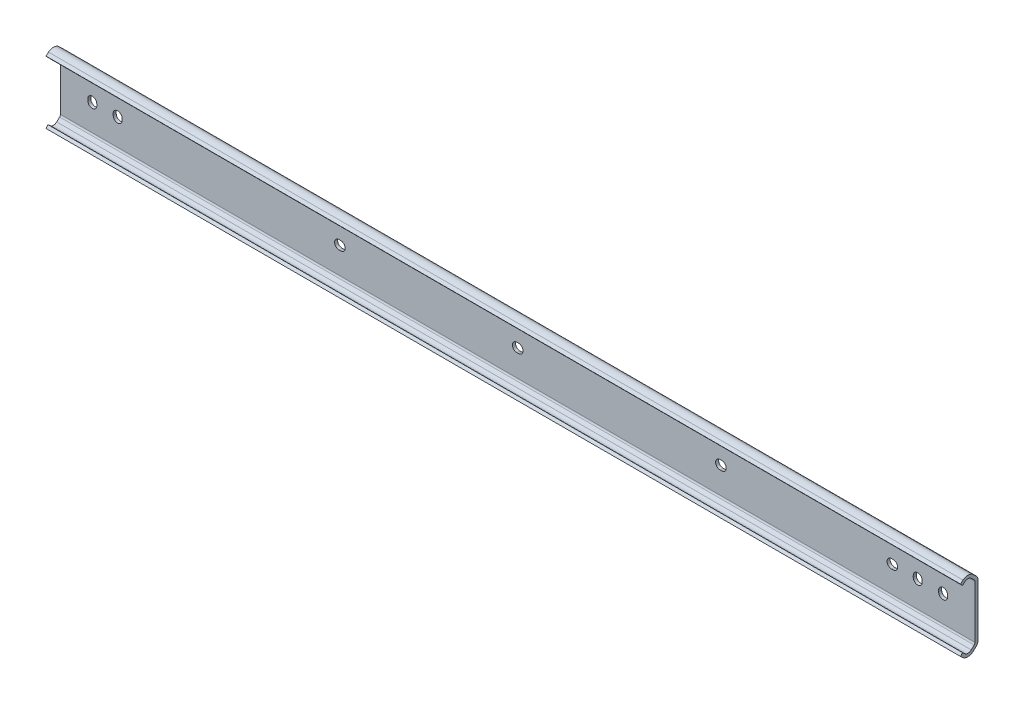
ISO-10303-21;
HEADER;
FILE_DESCRIPTION(('STEP AP214'),'2;1');
FILE_NAME('part.step','',(''),(''),'','','');
FILE_SCHEMA(('AUTOMOTIVE_DESIGN { 1 0 10303 214 1 1 1 1 }'));
ENDSEC;
DATA;
#1=APPLICATION_CONTEXT('core data for automotive mechanical design processes');
#2=APPLICATION_PROTOCOL_DEFINITION('international standard','automotive_design',2000,#1);
#3=PRODUCT_CONTEXT('',#1,'mechanical');
#4=PRODUCT('Part','Part','',(#3));
#5=PRODUCT_RELATED_PRODUCT_CATEGORY('part','',(#4));
#6=PRODUCT_DEFINITION_FORMATION('','',#4);
#7=PRODUCT_DEFINITION_CONTEXT('part definition',#1,'design');
#8=PRODUCT_DEFINITION('design','',#6,#7);
#9=PRODUCT_DEFINITION_SHAPE('','',#8);
#10=(LENGTH_UNIT() NAMED_UNIT(*) SI_UNIT(.MILLI.,.METRE.));
#11=(NAMED_UNIT(*) PLANE_ANGLE_UNIT() SI_UNIT($,.RADIAN.));
#12=(NAMED_UNIT(*) SI_UNIT($,.STERADIAN.) SOLID_ANGLE_UNIT());
#13=UNCERTAINTY_MEASURE_WITH_UNIT(LENGTH_MEASURE(1.E-05),#10,'distance_accuracy_value','');
#14=(GEOMETRIC_REPRESENTATION_CONTEXT(3) GLOBAL_UNCERTAINTY_ASSIGNED_CONTEXT((#13)) GLOBAL_UNIT_ASSIGNED_CONTEXT((#10,
#11,#12)) REPRESENTATION_CONTEXT('',''));
#15=CARTESIAN_POINT('',(0.,0.,0.));
#16=DIRECTION('',(0.,0.,1.));
#17=DIRECTION('',(1.,0.,0.));
#18=AXIS2_PLACEMENT_3D('',#15,#16,#17);
#19=CARTESIAN_POINT('',(-15.9,13.1771270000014,1.52400011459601));
#20=DIRECTION('',(0.,0.,1.));
#21=DIRECTION('',(-1.,0.,0.));
#22=AXIS2_PLACEMENT_3D('',#19,#20,#21);
#23=PLANE('',#22);
#24=DIRECTION('',(0.,-1.,0.));
#25=VECTOR('',#24,1.);
#26=CARTESIAN_POINT('',(-15.9,13.1771270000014,1.52400011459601));
#27=LINE('',#26,#25);
#28=CARTESIAN_POINT('',(-15.9,13.1771270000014,1.52400011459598));
#29=VERTEX_POINT('',#28);
#30=CARTESIAN_POINT('',(-15.9,-13.1771270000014,1.52400011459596));
#31=VERTEX_POINT('',#30);
#32=EDGE_CURVE('E745',#29,#31,#27,.T.);
#33=ORIENTED_EDGE('',*,*,#32,.T.);
#34=DIRECTION('',(-1.,0.,0.));
#35=VECTOR('',#34,1.);
#36=CARTESIAN_POINT('',(441.3,-13.1771270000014,1.52400011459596));
#37=LINE('',#36,#35);
#38=CARTESIAN_POINT('',(441.3,-13.1771270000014,1.52400011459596));
#39=VERTEX_POINT('',#38);
#40=EDGE_CURVE('E420',#39,#31,#37,.T.);
#41=ORIENTED_EDGE('',*,*,#40,.F.);
#42=DIRECTION('',(0.,-1.,0.));
#43=VECTOR('',#42,1.);
#44=CARTESIAN_POINT('',(441.3,13.1771270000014,1.52400011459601));
#45=LINE('',#44,#43);
#46=CARTESIAN_POINT('',(441.3,13.1771270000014,1.52400011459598));
#47=VERTEX_POINT('',#46);
#48=EDGE_CURVE('E715',#47,#39,#45,.T.);
#49=ORIENTED_EDGE('',*,*,#48,.F.);
#50=DIRECTION('',(1.,0.,0.));
#51=VECTOR('',#50,1.);
#52=CARTESIAN_POINT('',(-15.9,13.1771270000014,1.52400011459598));
#53=LINE('',#52,#51);
#54=EDGE_CURVE('E10',#29,#47,#53,.T.);
#55=ORIENTED_EDGE('',*,*,#54,.F.);
#56=EDGE_LOOP('',(#33,#41,#49,#55));
#57=FACE_BOUND('',#56,.T.);
#58=CARTESIAN_POINT('',(124.2,0.,1.52400011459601));
#59=DIRECTION('',(0.,0.,1.));
#60=DIRECTION('',(-1.,0.,0.));
#61=AXIS2_PLACEMENT_3D('',#58,#59,#60);
#62=CIRCLE('',#61,2.25);
#63=CARTESIAN_POINT('',(124.2,-2.25,1.52400011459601));
#64=VERTEX_POINT('',#63);
#65=CARTESIAN_POINT('',(124.2,2.25,1.52400011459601));
#66=VERTEX_POINT('',#65);
#67=EDGE_CURVE('E34',#64,#66,#62,.T.);
#68=ORIENTED_EDGE('',*,*,#67,.F.);
#69=DIRECTION('',(1.,0.,0.));
#70=VECTOR('',#69,1.);
#71=CARTESIAN_POINT('',(124.2,-2.25,1.52400011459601));
#72=LINE('',#71,#70);
#73=CARTESIAN_POINT('',(123.4,-2.25,1.52400011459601));
#74=VERTEX_POINT('',#73);
#75=EDGE_CURVE('E450',#74,#64,#72,.T.);
#76=ORIENTED_EDGE('',*,*,#75,.F.);
#77=CARTESIAN_POINT('',(123.4,0.,1.52400011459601));
#78=DIRECTION('',(0.,0.,1.));
#79=DIRECTION('',(-1.,0.,0.));
#80=AXIS2_PLACEMENT_3D('',#77,#78,#79);
#81=CIRCLE('',#80,2.25);
#82=CARTESIAN_POINT('',(123.4,2.25,1.52400011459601));
#83=VERTEX_POINT('',#82);
#84=EDGE_CURVE('E447',#83,#74,#81,.T.);
#85=ORIENTED_EDGE('',*,*,#84,.F.);
#86=DIRECTION('',(-1.,0.,0.));
#87=VECTOR('',#86,1.);
#88=CARTESIAN_POINT('',(123.4,2.25,1.52400011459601));
#89=LINE('',#88,#87);
#90=EDGE_CURVE('E445',#66,#83,#89,.T.);
#91=ORIENTED_EDGE('',*,*,#90,.F.);
#92=EDGE_LOOP('',(#68,#76,#85,#91));
#93=FACE_BOUND('',#92,.T.);
#94=CARTESIAN_POINT('',(213.1,0.,1.52400011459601));
#95=DIRECTION('',(0.,0.,1.));
#96=DIRECTION('',(-1.,0.,0.));
#97=AXIS2_PLACEMENT_3D('',#94,#95,#96);
#98=CIRCLE('',#97,2.25);
#99=CARTESIAN_POINT('',(213.1,-2.25,1.52400011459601));
#100=VERTEX_POINT('',#99);
#101=CARTESIAN_POINT('',(213.1,2.25,1.52400011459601));
#102=VERTEX_POINT('',#101);
#103=EDGE_CURVE('E472',#100,#102,#98,.T.);
#104=ORIENTED_EDGE('',*,*,#103,.F.);
#105=DIRECTION('',(1.,0.,0.));
#106=VECTOR('',#105,1.);
#107=CARTESIAN_POINT('',(213.1,-2.25,1.52400011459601));
#108=LINE('',#107,#106);
#109=CARTESIAN_POINT('',(212.3,-2.25,1.52400011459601));
#110=VERTEX_POINT('',#109);
#111=EDGE_CURVE('E480',#110,#100,#108,.T.);
#112=ORIENTED_EDGE('',*,*,#111,.F.);
#113=CARTESIAN_POINT('',(212.3,0.,1.52400011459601));
#114=DIRECTION('',(0.,0.,1.));
#115=DIRECTION('',(-1.,0.,0.));
#116=AXIS2_PLACEMENT_3D('',#113,#114,#115);
#117=CIRCLE('',#116,2.25);
#118=CARTESIAN_POINT('',(212.3,2.25,1.52400011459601));
#119=VERTEX_POINT('',#118);
#120=EDGE_CURVE('E477',#119,#110,#117,.T.);
#121=ORIENTED_EDGE('',*,*,#120,.F.);
#122=DIRECTION('',(-1.,0.,0.));
#123=VECTOR('',#122,1.);
#124=CARTESIAN_POINT('',(212.3,2.25,1.52400011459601));
#125=LINE('',#124,#123);
#126=EDGE_CURVE('E474',#102,#119,#125,.T.);
#127=ORIENTED_EDGE('',*,*,#126,.F.);
#128=EDGE_LOOP('',(#104,#112,#121,#127));
#129=FACE_BOUND('',#128,.T.);
#130=CARTESIAN_POINT('',(314.7,0.,1.52400011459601));
#131=DIRECTION('',(0.,0.,1.));
#132=DIRECTION('',(-1.,0.,0.));
#133=AXIS2_PLACEMENT_3D('',#130,#131,#132);
#134=CIRCLE('',#133,2.25);
#135=CARTESIAN_POINT('',(314.7,-2.25,1.52400011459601));
#136=VERTEX_POINT('',#135);
#137=CARTESIAN_POINT('',(314.7,2.25,1.52400011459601));
#138=VERTEX_POINT('',#137);
#139=EDGE_CURVE('E504',#136,#138,#134,.T.);
#140=ORIENTED_EDGE('',*,*,#139,.F.);
#141=DIRECTION('',(1.,0.,0.));
#142=VECTOR('',#141,1.);
#143=CARTESIAN_POINT('',(314.7,-2.25,1.52400011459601));
#144=LINE('',#143,#142);
#145=CARTESIAN_POINT('',(313.9,-2.25,1.52400011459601));
#146=VERTEX_POINT('',#145);
#147=EDGE_CURVE('E512',#146,#136,#144,.T.);
#148=ORIENTED_EDGE('',*,*,#147,.F.);
#149=CARTESIAN_POINT('',(313.9,0.,1.52400011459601));
#150=DIRECTION('',(0.,0.,1.));
#151=DIRECTION('',(-1.,0.,0.));
#152=AXIS2_PLACEMENT_3D('',#149,#150,#151);
#153=CIRCLE('',#152,2.25);
#154=CARTESIAN_POINT('',(313.9,2.25,1.52400011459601));
#155=VERTEX_POINT('',#154);
#156=EDGE_CURVE('E509',#155,#146,#153,.T.);
#157=ORIENTED_EDGE('',*,*,#156,.F.);
#158=DIRECTION('',(-1.,0.,0.));
#159=VECTOR('',#158,1.);
#160=CARTESIAN_POINT('',(313.9,2.25,1.52400011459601));
#161=LINE('',#160,#159);
#162=EDGE_CURVE('E506',#138,#155,#161,.T.);
#163=ORIENTED_EDGE('',*,*,#162,.F.);
#164=EDGE_LOOP('',(#140,#148,#157,#163));
#165=FACE_BOUND('',#164,.T.);
#166=CARTESIAN_POINT('',(0.,-0.4,1.52400011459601));
#167=DIRECTION('',(0.,0.,1.));
#168=DIRECTION('',(-1.,0.,0.));
#169=AXIS2_PLACEMENT_3D('',#166,#167,#168);
#170=CIRCLE('',#169,2.25);
#171=CARTESIAN_POINT('',(-2.24999999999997,-0.4,1.52400011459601));
#172=VERTEX_POINT('',#171);
#173=CARTESIAN_POINT('',(2.25000000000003,-0.400000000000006,1.52400011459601));
#174=VERTEX_POINT('',#173);
#175=EDGE_CURVE('E536',#172,#174,#170,.T.);
#176=ORIENTED_EDGE('',*,*,#175,.F.);
#177=DIRECTION('',(0.,-1.,0.));
#178=VECTOR('',#177,1.);
#179=CARTESIAN_POINT('',(-2.24999999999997,0.4,1.52400011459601));
#180=LINE('',#179,#178);
#181=CARTESIAN_POINT('',(-2.24999999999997,0.4,1.52400011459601));
#182=VERTEX_POINT('',#181);
#183=EDGE_CURVE('E544',#182,#172,#180,.T.);
#184=ORIENTED_EDGE('',*,*,#183,.F.);
#185=CARTESIAN_POINT('',(0.,0.4,1.52400011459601));
#186=DIRECTION('',(0.,0.,1.));
#187=DIRECTION('',(-1.,0.,0.));
#188=AXIS2_PLACEMENT_3D('',#185,#186,#187);
#189=CIRCLE('',#188,2.25);
#190=CARTESIAN_POINT('',(2.25000000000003,0.4,1.52400011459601));
#191=VERTEX_POINT('',#190);
#192=EDGE_CURVE('E541',#191,#182,#189,.T.);
#193=ORIENTED_EDGE('',*,*,#192,.F.);
#194=DIRECTION('',(0.,1.,0.));
#195=VECTOR('',#194,1.);
#196=CARTESIAN_POINT('',(2.25000000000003,-0.4,1.52400011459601));
#197=LINE('',#196,#195);
#198=EDGE_CURVE('E538',#174,#191,#197,.T.);
#199=ORIENTED_EDGE('',*,*,#198,.F.);
#200=EDGE_LOOP('',(#176,#184,#193,#199));
#201=FACE_BOUND('',#200,.T.);
#202=CARTESIAN_POINT('',(12.7,-0.4,1.52400011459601));
#203=DIRECTION('',(0.,0.,1.));
#204=DIRECTION('',(-1.,0.,0.));
#205=AXIS2_PLACEMENT_3D('',#202,#203,#204);
#206=CIRCLE('',#205,2.25);
#207=CARTESIAN_POINT('',(10.45,-0.4,1.52400011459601));
#208=VERTEX_POINT('',#207);
#209=CARTESIAN_POINT('',(14.95,-0.400000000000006,1.52400011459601));
#210=VERTEX_POINT('',#209);
#211=EDGE_CURVE('E568',#208,#210,#206,.T.);
#212=ORIENTED_EDGE('',*,*,#211,.F.);
#213=DIRECTION('',(0.,-1.,0.));
#214=VECTOR('',#213,1.);
#215=CARTESIAN_POINT('',(10.45,0.4,1.52400011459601));
#216=LINE('',#215,#214);
#217=CARTESIAN_POINT('',(10.45,0.4,1.52400011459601));
#218=VERTEX_POINT('',#217);
#219=EDGE_CURVE('E576',#218,#208,#216,.T.);
#220=ORIENTED_EDGE('',*,*,#219,.F.);
#221=CARTESIAN_POINT('',(12.7,0.4,1.52400011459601));
#222=DIRECTION('',(0.,0.,1.));
#223=DIRECTION('',(-1.,0.,0.));
#224=AXIS2_PLACEMENT_3D('',#221,#222,#223);
#225=CIRCLE('',#224,2.25);
#226=CARTESIAN_POINT('',(14.95,0.4,1.52400011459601));
#227=VERTEX_POINT('',#226);
#228=EDGE_CURVE('E573',#227,#218,#225,.T.);
#229=ORIENTED_EDGE('',*,*,#228,.F.);
#230=DIRECTION('',(0.,1.,0.));
#231=VECTOR('',#230,1.);
#232=CARTESIAN_POINT('',(14.95,-0.4,1.52400011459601));
#233=LINE('',#232,#231);
#234=EDGE_CURVE('E570',#210,#227,#233,.T.);
#235=ORIENTED_EDGE('',*,*,#234,.F.);
#236=EDGE_LOOP('',(#212,#220,#229,#235));
#237=FACE_BOUND('',#236,.T.);
#238=CARTESIAN_POINT('',(412.7,-0.4,1.52400011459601));
#239=DIRECTION('',(0.,0.,1.));
#240=DIRECTION('',(-1.,0.,0.));
#241=AXIS2_PLACEMENT_3D('',#238,#239,#240);
#242=CIRCLE('',#241,2.25);
#243=CARTESIAN_POINT('',(410.45,-0.4,1.52400011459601));
#244=VERTEX_POINT('',#243);
#245=CARTESIAN_POINT('',(414.95,-0.400000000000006,1.52400011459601));
#246=VERTEX_POINT('',#245);
#247=EDGE_CURVE('E600',#244,#246,#242,.T.);
#248=ORIENTED_EDGE('',*,*,#247,.F.);
#249=DIRECTION('',(0.,-1.,0.));
#250=VECTOR('',#249,1.);
#251=CARTESIAN_POINT('',(410.45,0.4,1.52400011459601));
#252=LINE('',#251,#250);
#253=CARTESIAN_POINT('',(410.45,0.4,1.52400011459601));
#254=VERTEX_POINT('',#253);
#255=EDGE_CURVE('E608',#254,#244,#252,.T.);
#256=ORIENTED_EDGE('',*,*,#255,.F.);
#257=CARTESIAN_POINT('',(412.7,0.4,1.52400011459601));
#258=DIRECTION('',(0.,0.,1.));
#259=DIRECTION('',(-1.,0.,0.));
#260=AXIS2_PLACEMENT_3D('',#257,#258,#259);
#261=CIRCLE('',#260,2.25);
#262=CARTESIAN_POINT('',(414.95,0.4,1.52400011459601));
#263=VERTEX_POINT('',#262);
#264=EDGE_CURVE('E605',#263,#254,#261,.T.);
#265=ORIENTED_EDGE('',*,*,#264,.F.);
#266=DIRECTION('',(0.,1.,0.));
#267=VECTOR('',#266,1.);
#268=CARTESIAN_POINT('',(414.95,-0.4,1.52400011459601));
#269=LINE('',#268,#267);
#270=EDGE_CURVE('E602',#246,#263,#269,.T.);
#271=ORIENTED_EDGE('',*,*,#270,.F.);
#272=EDGE_LOOP('',(#248,#256,#265,#271));
#273=FACE_BOUND('',#272,.T.);
#274=CARTESIAN_POINT('',(400.4,0.,1.52400011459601));
#275=DIRECTION('',(0.,0.,1.));
#276=DIRECTION('',(-1.,0.,0.));
#277=AXIS2_PLACEMENT_3D('',#274,#275,#276);
#278=CIRCLE('',#277,2.25);
#279=CARTESIAN_POINT('',(400.4,-2.25,1.52400011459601));
#280=VERTEX_POINT('',#279);
#281=CARTESIAN_POINT('',(400.4,2.25,1.52400011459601));
#282=VERTEX_POINT('',#281);
#283=EDGE_CURVE('E632',#280,#282,#278,.T.);
#284=ORIENTED_EDGE('',*,*,#283,.F.);
#285=DIRECTION('',(1.,0.,0.));
#286=VECTOR('',#285,1.);
#287=CARTESIAN_POINT('',(400.4,-2.25,1.52400011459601));
#288=LINE('',#287,#286);
#289=CARTESIAN_POINT('',(399.6,-2.25,1.52400011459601));
#290=VERTEX_POINT('',#289);
#291=EDGE_CURVE('E640',#290,#280,#288,.T.);
#292=ORIENTED_EDGE('',*,*,#291,.F.);
#293=CARTESIAN_POINT('',(399.6,0.,1.52400011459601));
#294=DIRECTION('',(0.,0.,1.));
#295=DIRECTION('',(-1.,0.,0.));
#296=AXIS2_PLACEMENT_3D('',#293,#294,#295);
#297=CIRCLE('',#296,2.25);
#298=CARTESIAN_POINT('',(399.6,2.25,1.52400011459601));
#299=VERTEX_POINT('',#298);
#300=EDGE_CURVE('E637',#299,#290,#297,.T.);
#301=ORIENTED_EDGE('',*,*,#300,.F.);
#302=DIRECTION('',(-1.,0.,0.));
#303=VECTOR('',#302,1.);
#304=CARTESIAN_POINT('',(399.6,2.25,1.52400011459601));
#305=LINE('',#304,#303);
#306=EDGE_CURVE('E634',#282,#299,#305,.T.);
#307=ORIENTED_EDGE('',*,*,#306,.F.);
#308=EDGE_LOOP('',(#284,#292,#301,#307));
#309=FACE_BOUND('',#308,.T.);
#310=CARTESIAN_POINT('',(425.4,-0.4,1.52400011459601));
#311=DIRECTION('',(0.,0.,1.));
#312=DIRECTION('',(-1.,0.,0.));
#313=AXIS2_PLACEMENT_3D('',#310,#311,#312);
#314=CIRCLE('',#313,2.25);
#315=CARTESIAN_POINT('',(423.15,-0.4,1.52400011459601));
#316=VERTEX_POINT('',#315);
#317=CARTESIAN_POINT('',(427.65,-0.400000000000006,1.52400011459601));
#318=VERTEX_POINT('',#317);
#319=EDGE_CURVE('E664',#316,#318,#314,.T.);
#320=ORIENTED_EDGE('',*,*,#319,.F.);
#321=DIRECTION('',(0.,-1.,0.));
#322=VECTOR('',#321,1.);
#323=CARTESIAN_POINT('',(423.15,0.4,1.52400011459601));
#324=LINE('',#323,#322);
#325=CARTESIAN_POINT('',(423.15,0.4,1.52400011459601));
#326=VERTEX_POINT('',#325);
#327=EDGE_CURVE('E672',#326,#316,#324,.T.);
#328=ORIENTED_EDGE('',*,*,#327,.F.);
#329=CARTESIAN_POINT('',(425.4,0.4,1.52400011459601));
#330=DIRECTION('',(0.,0.,1.));
#331=DIRECTION('',(-1.,0.,0.));
#332=AXIS2_PLACEMENT_3D('',#329,#330,#331);
#333=CIRCLE('',#332,2.25);
#334=CARTESIAN_POINT('',(427.65,0.4,1.52400011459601));
#335=VERTEX_POINT('',#334);
#336=EDGE_CURVE('E669',#335,#326,#333,.T.);
#337=ORIENTED_EDGE('',*,*,#336,.F.);
#338=DIRECTION('',(0.,1.,0.));
#339=VECTOR('',#338,1.);
#340=CARTESIAN_POINT('',(427.65,-0.4,1.52400011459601));
#341=LINE('',#340,#339);
#342=EDGE_CURVE('E666',#318,#335,#341,.T.);
#343=ORIENTED_EDGE('',*,*,#342,.F.);
#344=EDGE_LOOP('',(#320,#328,#337,#343));
#345=FACE_BOUND('',#344,.T.);
#346=ADVANCED_FACE('F17',(#57,#93,#129,#165,#201,#237,#273,#309,#345),#23,.T.);
#347=CARTESIAN_POINT('',(-15.9,13.1771270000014,2.82399974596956));
#348=DIRECTION('',(1.,0.,0.));
#349=DIRECTION('',(0.,0.,1.));
#350=AXIS2_PLACEMENT_3D('',#347,#348,#349);
#351=CYLINDRICAL_SURFACE('',#350,1.29999963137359);
#352=CARTESIAN_POINT('',(441.3,13.1771270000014,2.82399974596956));
#353=DIRECTION('',(-1.,0.,0.));
#354=DIRECTION('',(0.,0.,-1.));
#355=AXIS2_PLACEMENT_3D('',#352,#353,#354);
#356=CIRCLE('',#355,1.29999963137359);
#357=CARTESIAN_POINT('',(441.3,14.1308812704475,1.94062449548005));
#358=VERTEX_POINT('',#357);
#359=EDGE_CURVE('E712',#358,#47,#356,.T.);
#360=ORIENTED_EDGE('',*,*,#359,.F.);
#361=DIRECTION('',(1.,0.,0.));
#362=VECTOR('',#361,1.);
#363=CARTESIAN_POINT('',(-15.9,14.1308812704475,1.94062449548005));
#364=LINE('',#363,#362);
#365=CARTESIAN_POINT('',(-15.9,14.1308812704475,1.94062449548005));
#366=VERTEX_POINT('',#365);
#367=EDGE_CURVE('E26',#366,#358,#364,.T.);
#368=ORIENTED_EDGE('',*,*,#367,.F.);
#369=CARTESIAN_POINT('',(-15.9,13.1771270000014,2.82399974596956));
#370=DIRECTION('',(-1.,0.,0.));
#371=DIRECTION('',(0.,0.,-1.));
#372=AXIS2_PLACEMENT_3D('',#369,#370,#371);
#373=CIRCLE('',#372,1.29999963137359);
#374=EDGE_CURVE('E742',#366,#29,#373,.T.);
#375=ORIENTED_EDGE('',*,*,#374,.T.);
#376=ORIENTED_EDGE('',*,*,#54,.T.);
#377=EDGE_LOOP('',(#360,#368,#375,#376));
#378=FACE_BOUND('',#377,.T.);
#379=ADVANCED_FACE('F801',(#378),#351,.F.);
#380=CARTESIAN_POINT('',(-15.9,15.4973237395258,3.41593142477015));
#381=DIRECTION('',(0.,-0.733657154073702,0.679519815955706));
#382=DIRECTION('',(0.,-0.679519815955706,-0.733657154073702));
#383=AXIS2_PLACEMENT_3D('',#380,#381,#382);
#384=PLANE('',#383);
#385=DIRECTION('',(0.,-0.679519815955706,-0.733657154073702));
#386=VECTOR('',#385,1.);
#387=CARTESIAN_POINT('',(441.3,15.4973237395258,3.41593142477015));
#388=LINE('',#387,#386);
#389=CARTESIAN_POINT('',(441.3,15.4973237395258,3.41593142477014));
#390=VERTEX_POINT('',#389);
#391=EDGE_CURVE('E709',#390,#358,#388,.T.);
#392=ORIENTED_EDGE('',*,*,#391,.F.);
#393=DIRECTION('',(1.,0.,0.));
#394=VECTOR('',#393,1.);
#395=CARTESIAN_POINT('',(-15.9,15.4973237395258,3.41593142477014));
#396=LINE('',#395,#394);
#397=CARTESIAN_POINT('',(-15.9,15.4973237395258,3.41593142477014));
#398=VERTEX_POINT('',#397);
#399=EDGE_CURVE('E748',#398,#390,#396,.T.);
#400=ORIENTED_EDGE('',*,*,#399,.F.);
#401=DIRECTION('',(0.,-0.679519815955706,-0.733657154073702));
#402=VECTOR('',#401,1.);
#403=CARTESIAN_POINT('',(-15.9,15.4973237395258,3.41593142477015));
#404=LINE('',#403,#402);
#405=EDGE_CURVE('E739',#398,#366,#404,.T.);
#406=ORIENTED_EDGE('',*,*,#405,.T.);
#407=ORIENTED_EDGE('',*,*,#367,.T.);
#408=EDGE_LOOP('',(#392,#400,#406,#407));
#409=FACE_BOUND('',#408,.T.);
#410=ADVANCED_FACE('F797',(#409),#384,.T.);
#411=CARTESIAN_POINT('',(-15.9,13.745000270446,5.04999949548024));
#412=DIRECTION('',(1.,0.,0.));
#413=DIRECTION('',(0.,0.,1.));
#414=AXIS2_PLACEMENT_3D('',#411,#412,#413);
#415=CYLINDRICAL_SURFACE('',#414,2.39600000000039);
#416=CARTESIAN_POINT('',(441.3,13.745000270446,5.04999949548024));
#417=DIRECTION('',(-1.,0.,0.));
#418=DIRECTION('',(0.,0.,-1.));
#419=AXIS2_PLACEMENT_3D('',#416,#417,#418);
#420=CIRCLE('',#419,2.39600000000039);
#421=CARTESIAN_POINT('',(441.3,15.4018251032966,6.78082226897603));
#422=VERTEX_POINT('',#421);
#423=EDGE_CURVE('E706',#422,#390,#420,.T.);
#424=ORIENTED_EDGE('',*,*,#423,.F.);
#425=DIRECTION('',(1.,0.,0.));
#426=VECTOR('',#425,1.);
#427=CARTESIAN_POINT('',(-15.9,15.4018251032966,6.78082226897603));
#428=LINE('',#427,#426);
#429=CARTESIAN_POINT('',(-15.9,15.4018251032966,6.78082226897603));
#430=VERTEX_POINT('',#429);
#431=EDGE_CURVE('E750',#430,#422,#428,.T.);
#432=ORIENTED_EDGE('',*,*,#431,.F.);
#433=CARTESIAN_POINT('',(-15.9,13.745000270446,5.04999949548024));
#434=DIRECTION('',(-1.,0.,0.));
#435=DIRECTION('',(0.,0.,-1.));
#436=AXIS2_PLACEMENT_3D('',#433,#434,#435);
#437=CIRCLE('',#436,2.39600000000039);
#438=EDGE_CURVE('E736',#430,#398,#437,.T.);
#439=ORIENTED_EDGE('',*,*,#438,.T.);
#440=ORIENTED_EDGE('',*,*,#399,.T.);
#441=EDGE_LOOP('',(#424,#432,#439,#440));
#442=FACE_BOUND('',#441,.T.);
#443=ADVANCED_FACE('F793',(#442),#415,.F.);
#444=CARTESIAN_POINT('',(-15.9,15.4018251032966,6.78082226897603));
#445=DIRECTION('',(0.,-0.741021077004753,-0.671481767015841));
#446=DIRECTION('',(0.,0.671481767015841,-0.741021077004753));
#447=AXIS2_PLACEMENT_3D('',#444,#445,#446);
#448=PLANE('',#447);
#449=DIRECTION('',(0.,0.671481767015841,-0.741021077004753));
#450=VECTOR('',#449,1.);
#451=CARTESIAN_POINT('',(441.3,15.4018251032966,6.78082226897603));
#452=LINE('',#451,#450);
#453=CARTESIAN_POINT('',(441.3,14.5356842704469,7.73666149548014));
#454=VERTEX_POINT('',#453);
#455=EDGE_CURVE('E703',#454,#422,#452,.T.);
#456=ORIENTED_EDGE('',*,*,#455,.F.);
#457=DIRECTION('',(1.,0.,0.));
#458=VECTOR('',#457,1.);
#459=CARTESIAN_POINT('',(-15.9,14.5356842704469,7.73666149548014));
#460=LINE('',#459,#458);
#461=CARTESIAN_POINT('',(-15.9,14.5356842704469,7.73666149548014));
#462=VERTEX_POINT('',#461);
#463=EDGE_CURVE('E752',#462,#454,#460,.T.);
#464=ORIENTED_EDGE('',*,*,#463,.F.);
#465=DIRECTION('',(0.,0.671481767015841,-0.741021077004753));
#466=VECTOR('',#465,1.);
#467=CARTESIAN_POINT('',(-15.9,15.4018251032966,6.78082226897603));
#468=LINE('',#467,#466);
#469=EDGE_CURVE('E733',#462,#430,#468,.T.);
#470=ORIENTED_EDGE('',*,*,#469,.T.);
#471=ORIENTED_EDGE('',*,*,#431,.T.);
#472=EDGE_LOOP('',(#456,#464,#470,#471));
#473=FACE_BOUND('',#472,.T.);
#474=ADVANCED_FACE('F789',(#473),#448,.T.);
#475=CARTESIAN_POINT('',(-15.9,14.5356842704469,7.73666149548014));
#476=DIRECTION('',(0.,-0.671481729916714,0.741021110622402));
#477=DIRECTION('',(0.,-0.741021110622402,-0.671481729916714));
#478=AXIS2_PLACEMENT_3D('',#475,#476,#477);
#479=PLANE('',#478);
#480=DIRECTION('',(0.,-0.741021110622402,-0.671481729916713));
#481=VECTOR('',#480,1.);
#482=CARTESIAN_POINT('',(441.3,14.5356842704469,7.73666149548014));
#483=LINE('',#482,#481);
#484=CARTESIAN_POINT('',(441.3,15.6649899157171,8.75999011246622));
#485=VERTEX_POINT('',#484);
#486=EDGE_CURVE('E700',#485,#454,#483,.T.);
#487=ORIENTED_EDGE('',*,*,#486,.F.);
#488=DIRECTION('',(1.,0.,0.));
#489=VECTOR('',#488,1.);
#490=CARTESIAN_POINT('',(-15.9,15.6649899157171,8.75999011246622));
#491=LINE('',#490,#489);
#492=CARTESIAN_POINT('',(-15.9,15.6649899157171,8.75999011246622));
#493=VERTEX_POINT('',#492);
#494=EDGE_CURVE('E754',#493,#485,#491,.T.);
#495=ORIENTED_EDGE('',*,*,#494,.F.);
#496=DIRECTION('',(0.,-0.741021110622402,-0.671481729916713));
#497=VECTOR('',#496,1.);
#498=CARTESIAN_POINT('',(-15.9,14.5356842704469,7.73666149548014));
#499=LINE('',#498,#497);
#500=EDGE_CURVE('E730',#493,#462,#499,.T.);
#501=ORIENTED_EDGE('',*,*,#500,.T.);
#502=ORIENTED_EDGE('',*,*,#463,.T.);
#503=EDGE_LOOP('',(#487,#495,#501,#502));
#504=FACE_BOUND('',#503,.T.);
#505=ADVANCED_FACE('F785',(#504),#479,.T.);
#506=CARTESIAN_POINT('',(-15.9,16.7914015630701,7.51692662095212));
#507=DIRECTION('',(0.,0.741020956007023,0.671481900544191));
#508=DIRECTION('',(0.,-0.671481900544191,0.741020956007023));
#509=AXIS2_PLACEMENT_3D('',#506,#507,#508);
#510=PLANE('',#509);
#511=DIRECTION('',(0.,-0.671481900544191,0.741020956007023));
#512=VECTOR('',#511,1.);
#513=CARTESIAN_POINT('',(441.3,16.7914015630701,7.51692662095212));
#514=LINE('',#513,#512);
#515=CARTESIAN_POINT('',(441.3,16.7914015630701,7.5169266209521));
#516=VERTEX_POINT('',#515);
#517=EDGE_CURVE('E697',#516,#485,#514,.T.);
#518=ORIENTED_EDGE('',*,*,#517,.F.);
#519=DIRECTION('',(1.,0.,0.));
#520=VECTOR('',#519,1.);
#521=CARTESIAN_POINT('',(-15.9,16.7914015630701,7.5169266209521));
#522=LINE('',#521,#520);
#523=CARTESIAN_POINT('',(-15.9,16.7914015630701,7.5169266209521));
#524=VERTEX_POINT('',#523);
#525=EDGE_CURVE('E756',#524,#516,#522,.T.);
#526=ORIENTED_EDGE('',*,*,#525,.F.);
#527=DIRECTION('',(0.,-0.671481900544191,0.741020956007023));
#528=VECTOR('',#527,1.);
#529=CARTESIAN_POINT('',(-15.9,16.7914015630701,7.51692662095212));
#530=LINE('',#529,#528);
#531=EDGE_CURVE('E727',#524,#493,#530,.T.);
#532=ORIENTED_EDGE('',*,*,#531,.T.);
#533=ORIENTED_EDGE('',*,*,#494,.T.);
#534=EDGE_LOOP('',(#518,#526,#532,#533));
#535=FACE_BOUND('',#534,.T.);
#536=ADVANCED_FACE('F781',(#535),#510,.T.);
#537=CARTESIAN_POINT('',(-15.9,13.745000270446,5.04999949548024));
#538=DIRECTION('',(1.,0.,0.));
#539=DIRECTION('',(0.,0.,1.));
#540=AXIS2_PLACEMENT_3D('',#537,#538,#539);
#541=CYLINDRICAL_SURFACE('',#540,3.91998600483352);
#542=CARTESIAN_POINT('',(441.3,13.745000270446,5.04999949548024));
#543=DIRECTION('',(1.,0.,0.));
#544=DIRECTION('',(0.,0.,-1.));
#545=AXIS2_PLACEMENT_3D('',#542,#543,#544);
#546=CIRCLE('',#545,3.91998600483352);
#547=CARTESIAN_POINT('',(441.3,16.620926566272,2.38629188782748));
#548=VERTEX_POINT('',#547);
#549=EDGE_CURVE('E694',#548,#516,#546,.T.);
#550=ORIENTED_EDGE('',*,*,#549,.F.);
#551=DIRECTION('',(1.,0.,0.));
#552=VECTOR('',#551,1.);
#553=CARTESIAN_POINT('',(-15.9,16.620926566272,2.38629188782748));
#554=LINE('',#553,#552);
#555=CARTESIAN_POINT('',(-15.9,16.620926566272,2.38629188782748));
#556=VERTEX_POINT('',#555);
#557=EDGE_CURVE('E758',#556,#548,#554,.T.);
#558=ORIENTED_EDGE('',*,*,#557,.F.);
#559=CARTESIAN_POINT('',(-15.9,13.745000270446,5.04999949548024));
#560=DIRECTION('',(1.,0.,0.));
#561=DIRECTION('',(0.,0.,-1.));
#562=AXIS2_PLACEMENT_3D('',#559,#560,#561);
#563=CIRCLE('',#562,3.91998600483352);
#564=EDGE_CURVE('E724',#556,#524,#563,.T.);
#565=ORIENTED_EDGE('',*,*,#564,.T.);
#566=ORIENTED_EDGE('',*,*,#525,.T.);
#567=EDGE_LOOP('',(#550,#558,#565,#566));
#568=FACE_BOUND('',#567,.T.);
#569=ADVANCED_FACE('F777',(#568),#541,.T.);
#570=CARTESIAN_POINT('',(-15.9,16.620926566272,2.38629188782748));
#571=DIRECTION('',(0.,0.73365728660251,-0.679519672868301));
#572=DIRECTION('',(0.,0.679519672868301,0.73365728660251));
#573=AXIS2_PLACEMENT_3D('',#570,#571,#572);
#574=PLANE('',#573);
#575=DIRECTION('',(0.,0.679519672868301,0.73365728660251));
#576=VECTOR('',#575,1.);
#577=CARTESIAN_POINT('',(441.3,16.620926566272,2.38629188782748));
#578=LINE('',#577,#576);
#579=CARTESIAN_POINT('',(441.3,15.2489749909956,0.90503636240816));
#580=VERTEX_POINT('',#579);
#581=EDGE_CURVE('E692',#580,#548,#578,.T.);
#582=ORIENTED_EDGE('',*,*,#581,.F.);
#583=DIRECTION('',(1.,0.,0.));
#584=VECTOR('',#583,1.);
#585=CARTESIAN_POINT('',(-15.9,15.2489749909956,0.90503636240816));
#586=LINE('',#585,#584);
#587=CARTESIAN_POINT('',(-15.9,15.2489749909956,0.90503636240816));
#588=VERTEX_POINT('',#587);
#589=EDGE_CURVE('E760',#588,#580,#586,.T.);
#590=ORIENTED_EDGE('',*,*,#589,.F.);
#591=DIRECTION('',(0.,0.679519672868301,0.73365728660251));
#592=VECTOR('',#591,1.);
#593=CARTESIAN_POINT('',(-15.9,16.620926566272,2.38629188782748));
#594=LINE('',#593,#592);
#595=EDGE_CURVE('E722',#588,#556,#594,.T.);
#596=ORIENTED_EDGE('',*,*,#595,.T.);
#597=ORIENTED_EDGE('',*,*,#557,.T.);
#598=EDGE_LOOP('',(#582,#590,#596,#597));
#599=FACE_BOUND('',#598,.T.);
#600=ADVANCED_FACE('F773',(#599),#574,.T.);
#601=CARTESIAN_POINT('',(-15.9,13.1771270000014,2.82399974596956));
#602=DIRECTION('',(1.,0.,0.));
#603=DIRECTION('',(0.,0.,1.));
#604=AXIS2_PLACEMENT_3D('',#601,#602,#603);
#605=CYLINDRICAL_SURFACE('',#604,2.82399974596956);
#606=CARTESIAN_POINT('',(441.3,13.1771270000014,2.82399974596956));
#607=DIRECTION('',(1.,0.,0.));
#608=DIRECTION('',(0.,0.,-1.));
#609=AXIS2_PLACEMENT_3D('',#606,#607,#608);
#610=CIRCLE('',#609,2.82399974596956);
#611=CARTESIAN_POINT('',(441.3,13.1771270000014,0.));
#612=VERTEX_POINT('',#611);
#613=EDGE_CURVE('E689',#612,#580,#610,.T.);
#614=ORIENTED_EDGE('',*,*,#613,.F.);
#615=DIRECTION('',(1.,0.,0.));
#616=VECTOR('',#615,1.);
#617=CARTESIAN_POINT('',(-15.9,13.1771270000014,0.));
#618=LINE('',#617,#616);
#619=CARTESIAN_POINT('',(-15.9,13.1771270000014,0.));
#620=VERTEX_POINT('',#619);
#621=EDGE_CURVE('E21',#620,#612,#618,.T.);
#622=ORIENTED_EDGE('',*,*,#621,.F.);
#623=CARTESIAN_POINT('',(-15.9,13.1771270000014,2.82399974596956));
#624=DIRECTION('',(1.,0.,0.));
#625=DIRECTION('',(0.,0.,-1.));
#626=AXIS2_PLACEMENT_3D('',#623,#624,#625);
#627=CIRCLE('',#626,2.82399974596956);
#628=EDGE_CURVE('E719',#620,#588,#627,.T.);
#629=ORIENTED_EDGE('',*,*,#628,.T.);
#630=ORIENTED_EDGE('',*,*,#589,.T.);
#631=EDGE_LOOP('',(#614,#622,#629,#630));
#632=FACE_BOUND('',#631,.T.);
#633=ADVANCED_FACE('F769',(#632),#605,.T.);
#634=CARTESIAN_POINT('',(-15.9,13.1771270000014,0.));
#635=DIRECTION('',(0.,0.,-1.));
#636=DIRECTION('',(1.,0.,0.));
#637=AXIS2_PLACEMENT_3D('',#634,#635,#636);
#638=PLANE('',#637);
#639=ORIENTED_EDGE('',*,*,#621,.T.);
#640=DIRECTION('',(0.,1.,0.));
#641=VECTOR('',#640,1.);
#642=CARTESIAN_POINT('',(441.3,13.1771270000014,0.));
#643=LINE('',#642,#641);
#644=CARTESIAN_POINT('',(441.3,-13.1771270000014,0.));
#645=VERTEX_POINT('',#644);
#646=EDGE_CURVE('E687',#645,#612,#643,.T.);
#647=ORIENTED_EDGE('',*,*,#646,.F.);
#648=DIRECTION('',(-1.,0.,0.));
#649=VECTOR('',#648,1.);
#650=CARTESIAN_POINT('',(441.3,-13.1771270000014,0.));
#651=LINE('',#650,#649);
#652=CARTESIAN_POINT('',(-15.9,-13.1771270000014,0.));
#653=VERTEX_POINT('',#652);
#654=EDGE_CURVE('E373',#645,#653,#651,.T.);
#655=ORIENTED_EDGE('',*,*,#654,.T.);
#656=DIRECTION('',(0.,1.,0.));
#657=VECTOR('',#656,1.);
#658=CARTESIAN_POINT('',(-15.9,13.1771270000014,0.));
#659=LINE('',#658,#657);
#660=EDGE_CURVE('E717',#653,#620,#659,.T.);
#661=ORIENTED_EDGE('',*,*,#660,.T.);
#662=EDGE_LOOP('',(#639,#647,#655,#661));
#663=FACE_BOUND('',#662,.T.);
#664=CARTESIAN_POINT('',(124.2,0.,0.));
#665=DIRECTION('',(0.,0.,-1.));
#666=DIRECTION('',(1.,0.,0.));
#667=AXIS2_PLACEMENT_3D('',#664,#665,#666);
#668=CIRCLE('',#667,2.25);
#669=CARTESIAN_POINT('',(124.2,-2.25,0.));
#670=VERTEX_POINT('',#669);
#671=CARTESIAN_POINT('',(124.2,2.25,0.));
#672=VERTEX_POINT('',#671);
#673=EDGE_CURVE('E441',#670,#672,#668,.F.);
#674=ORIENTED_EDGE('',*,*,#673,.T.);
#675=DIRECTION('',(-1.,0.,0.));
#676=VECTOR('',#675,1.);
#677=CARTESIAN_POINT('',(123.4,2.25,0.));
#678=LINE('',#677,#676);
#679=CARTESIAN_POINT('',(123.4,2.25,0.));
#680=VERTEX_POINT('',#679);
#681=EDGE_CURVE('E456',#672,#680,#678,.T.);
#682=ORIENTED_EDGE('',*,*,#681,.T.);
#683=CARTESIAN_POINT('',(123.4,0.,0.));
#684=DIRECTION('',(0.,0.,-1.));
#685=DIRECTION('',(1.,0.,0.));
#686=AXIS2_PLACEMENT_3D('',#683,#684,#685);
#687=CIRCLE('',#686,2.25);
#688=CARTESIAN_POINT('',(123.4,-2.25,0.));
#689=VERTEX_POINT('',#688);
#690=EDGE_CURVE('E419',#680,#689,#687,.F.);
#691=ORIENTED_EDGE('',*,*,#690,.T.);
#692=DIRECTION('',(1.,0.,0.));
#693=VECTOR('',#692,1.);
#694=CARTESIAN_POINT('',(124.2,-2.25,0.));
#695=LINE('',#694,#693);
#696=EDGE_CURVE('E438',#689,#670,#695,.T.);
#697=ORIENTED_EDGE('',*,*,#696,.T.);
#698=EDGE_LOOP('',(#674,#682,#691,#697));
#699=FACE_BOUND('',#698,.T.);
#700=CARTESIAN_POINT('',(213.1,0.,0.));
#701=DIRECTION('',(0.,0.,-1.));
#702=DIRECTION('',(1.,0.,0.));
#703=AXIS2_PLACEMENT_3D('',#700,#701,#702);
#704=CIRCLE('',#703,2.25);
#705=CARTESIAN_POINT('',(213.1,-2.25,0.));
#706=VERTEX_POINT('',#705);
#707=CARTESIAN_POINT('',(213.1,2.25,0.));
#708=VERTEX_POINT('',#707);
#709=EDGE_CURVE('E469',#706,#708,#704,.F.);
#710=ORIENTED_EDGE('',*,*,#709,.T.);
#711=DIRECTION('',(-1.,0.,0.));
#712=VECTOR('',#711,1.);
#713=CARTESIAN_POINT('',(212.3,2.25,0.));
#714=LINE('',#713,#712);
#715=CARTESIAN_POINT('',(212.3,2.25,0.));
#716=VERTEX_POINT('',#715);
#717=EDGE_CURVE('E486',#708,#716,#714,.T.);
#718=ORIENTED_EDGE('',*,*,#717,.T.);
#719=CARTESIAN_POINT('',(212.3,0.,0.));
#720=DIRECTION('',(0.,0.,-1.));
#721=DIRECTION('',(1.,0.,0.));
#722=AXIS2_PLACEMENT_3D('',#719,#720,#721);
#723=CIRCLE('',#722,2.25);
#724=CARTESIAN_POINT('',(212.3,-2.25,0.));
#725=VERTEX_POINT('',#724);
#726=EDGE_CURVE('E463',#716,#725,#723,.F.);
#727=ORIENTED_EDGE('',*,*,#726,.T.);
#728=DIRECTION('',(1.,0.,0.));
#729=VECTOR('',#728,1.);
#730=CARTESIAN_POINT('',(213.1,-2.25,0.));
#731=LINE('',#730,#729);
#732=EDGE_CURVE('E466',#725,#706,#731,.T.);
#733=ORIENTED_EDGE('',*,*,#732,.T.);
#734=EDGE_LOOP('',(#710,#718,#727,#733));
#735=FACE_BOUND('',#734,.T.);
#736=CARTESIAN_POINT('',(314.7,0.,0.));
#737=DIRECTION('',(0.,0.,-1.));
#738=DIRECTION('',(1.,0.,0.));
#739=AXIS2_PLACEMENT_3D('',#736,#737,#738);
#740=CIRCLE('',#739,2.25);
#741=CARTESIAN_POINT('',(314.7,-2.25,0.));
#742=VERTEX_POINT('',#741);
#743=CARTESIAN_POINT('',(314.7,2.25,0.));
#744=VERTEX_POINT('',#743);
#745=EDGE_CURVE('E501',#742,#744,#740,.F.);
#746=ORIENTED_EDGE('',*,*,#745,.T.);
#747=DIRECTION('',(-1.,0.,0.));
#748=VECTOR('',#747,1.);
#749=CARTESIAN_POINT('',(313.9,2.25,0.));
#750=LINE('',#749,#748);
#751=CARTESIAN_POINT('',(313.9,2.25,0.));
#752=VERTEX_POINT('',#751);
#753=EDGE_CURVE('E518',#744,#752,#750,.T.);
#754=ORIENTED_EDGE('',*,*,#753,.T.);
#755=CARTESIAN_POINT('',(313.9,0.,0.));
#756=DIRECTION('',(0.,0.,-1.));
#757=DIRECTION('',(1.,0.,0.));
#758=AXIS2_PLACEMENT_3D('',#755,#756,#757);
#759=CIRCLE('',#758,2.25);
#760=CARTESIAN_POINT('',(313.9,-2.25,0.));
#761=VERTEX_POINT('',#760);
#762=EDGE_CURVE('E495',#752,#761,#759,.F.);
#763=ORIENTED_EDGE('',*,*,#762,.T.);
#764=DIRECTION('',(1.,0.,0.));
#765=VECTOR('',#764,1.);
#766=CARTESIAN_POINT('',(314.7,-2.25,0.));
#767=LINE('',#766,#765);
#768=EDGE_CURVE('E498',#761,#742,#767,.T.);
#769=ORIENTED_EDGE('',*,*,#768,.T.);
#770=EDGE_LOOP('',(#746,#754,#763,#769));
#771=FACE_BOUND('',#770,.T.);
#772=CARTESIAN_POINT('',(0.,-0.4,0.));
#773=DIRECTION('',(0.,0.,-1.));
#774=DIRECTION('',(1.,0.,0.));
#775=AXIS2_PLACEMENT_3D('',#772,#773,#774);
#776=CIRCLE('',#775,2.25);
#777=CARTESIAN_POINT('',(-2.24999999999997,-0.4,0.));
#778=VERTEX_POINT('',#777);
#779=CARTESIAN_POINT('',(2.25000000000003,-0.4,0.));
#780=VERTEX_POINT('',#779);
#781=EDGE_CURVE('E533',#778,#780,#776,.F.);
#782=ORIENTED_EDGE('',*,*,#781,.T.);
#783=DIRECTION('',(0.,1.,0.));
#784=VECTOR('',#783,1.);
#785=CARTESIAN_POINT('',(2.25000000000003,-0.4,0.));
#786=LINE('',#785,#784);
#787=CARTESIAN_POINT('',(2.25000000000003,0.4,0.));
#788=VERTEX_POINT('',#787);
#789=EDGE_CURVE('E550',#780,#788,#786,.T.);
#790=ORIENTED_EDGE('',*,*,#789,.T.);
#791=CARTESIAN_POINT('',(0.,0.4,0.));
#792=DIRECTION('',(0.,0.,-1.));
#793=DIRECTION('',(1.,0.,0.));
#794=AXIS2_PLACEMENT_3D('',#791,#792,#793);
#795=CIRCLE('',#794,2.25);
#796=CARTESIAN_POINT('',(-2.24999999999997,0.4,0.));
#797=VERTEX_POINT('',#796);
#798=EDGE_CURVE('E527',#788,#797,#795,.F.);
#799=ORIENTED_EDGE('',*,*,#798,.T.);
#800=DIRECTION('',(0.,-1.,0.));
#801=VECTOR('',#800,1.);
#802=CARTESIAN_POINT('',(-2.24999999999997,0.4,0.));
#803=LINE('',#802,#801);
#804=EDGE_CURVE('E530',#797,#778,#803,.T.);
#805=ORIENTED_EDGE('',*,*,#804,.T.);
#806=EDGE_LOOP('',(#782,#790,#799,#805));
#807=FACE_BOUND('',#806,.T.);
#808=CARTESIAN_POINT('',(12.7,-0.4,0.));
#809=DIRECTION('',(0.,0.,-1.));
#810=DIRECTION('',(1.,0.,0.));
#811=AXIS2_PLACEMENT_3D('',#808,#809,#810);
#812=CIRCLE('',#811,2.25);
#813=CARTESIAN_POINT('',(10.45,-0.4,0.));
#814=VERTEX_POINT('',#813);
#815=CARTESIAN_POINT('',(14.95,-0.4,0.));
#816=VERTEX_POINT('',#815);
#817=EDGE_CURVE('E565',#814,#816,#812,.F.);
#818=ORIENTED_EDGE('',*,*,#817,.T.);
#819=DIRECTION('',(0.,1.,0.));
#820=VECTOR('',#819,1.);
#821=CARTESIAN_POINT('',(14.95,-0.4,0.));
#822=LINE('',#821,#820);
#823=CARTESIAN_POINT('',(14.95,0.4,0.));
#824=VERTEX_POINT('',#823);
#825=EDGE_CURVE('E582',#816,#824,#822,.T.);
#826=ORIENTED_EDGE('',*,*,#825,.T.);
#827=CARTESIAN_POINT('',(12.7,0.4,0.));
#828=DIRECTION('',(0.,0.,-1.));
#829=DIRECTION('',(1.,0.,0.));
#830=AXIS2_PLACEMENT_3D('',#827,#828,#829);
#831=CIRCLE('',#830,2.25);
#832=CARTESIAN_POINT('',(10.45,0.4,0.));
#833=VERTEX_POINT('',#832);
#834=EDGE_CURVE('E559',#824,#833,#831,.F.);
#835=ORIENTED_EDGE('',*,*,#834,.T.);
#836=DIRECTION('',(0.,-1.,0.));
#837=VECTOR('',#836,1.);
#838=CARTESIAN_POINT('',(10.45,0.4,0.));
#839=LINE('',#838,#837);
#840=EDGE_CURVE('E562',#833,#814,#839,.T.);
#841=ORIENTED_EDGE('',*,*,#840,.T.);
#842=EDGE_LOOP('',(#818,#826,#835,#841));
#843=FACE_BOUND('',#842,.T.);
#844=CARTESIAN_POINT('',(412.7,-0.4,0.));
#845=DIRECTION('',(0.,0.,-1.));
#846=DIRECTION('',(1.,0.,0.));
#847=AXIS2_PLACEMENT_3D('',#844,#845,#846);
#848=CIRCLE('',#847,2.25);
#849=CARTESIAN_POINT('',(410.45,-0.4,0.));
#850=VERTEX_POINT('',#849);
#851=CARTESIAN_POINT('',(414.95,-0.4,0.));
#852=VERTEX_POINT('',#851);
#853=EDGE_CURVE('E597',#850,#852,#848,.F.);
#854=ORIENTED_EDGE('',*,*,#853,.T.);
#855=DIRECTION('',(0.,1.,0.));
#856=VECTOR('',#855,1.);
#857=CARTESIAN_POINT('',(414.95,-0.4,0.));
#858=LINE('',#857,#856);
#859=CARTESIAN_POINT('',(414.95,0.4,0.));
#860=VERTEX_POINT('',#859);
#861=EDGE_CURVE('E614',#852,#860,#858,.T.);
#862=ORIENTED_EDGE('',*,*,#861,.T.);
#863=CARTESIAN_POINT('',(412.7,0.4,0.));
#864=DIRECTION('',(0.,0.,-1.));
#865=DIRECTION('',(1.,0.,0.));
#866=AXIS2_PLACEMENT_3D('',#863,#864,#865);
#867=CIRCLE('',#866,2.25);
#868=CARTESIAN_POINT('',(410.45,0.4,0.));
#869=VERTEX_POINT('',#868);
#870=EDGE_CURVE('E591',#860,#869,#867,.F.);
#871=ORIENTED_EDGE('',*,*,#870,.T.);
#872=DIRECTION('',(0.,-1.,0.));
#873=VECTOR('',#872,1.);
#874=CARTESIAN_POINT('',(410.45,0.4,0.));
#875=LINE('',#874,#873);
#876=EDGE_CURVE('E594',#869,#850,#875,.T.);
#877=ORIENTED_EDGE('',*,*,#876,.T.);
#878=EDGE_LOOP('',(#854,#862,#871,#877));
#879=FACE_BOUND('',#878,.T.);
#880=CARTESIAN_POINT('',(400.4,0.,0.));
#881=DIRECTION('',(0.,0.,-1.));
#882=DIRECTION('',(1.,0.,0.));
#883=AXIS2_PLACEMENT_3D('',#880,#881,#882);
#884=CIRCLE('',#883,2.25);
#885=CARTESIAN_POINT('',(400.4,-2.25,0.));
#886=VERTEX_POINT('',#885);
#887=CARTESIAN_POINT('',(400.4,2.25,0.));
#888=VERTEX_POINT('',#887);
#889=EDGE_CURVE('E629',#886,#888,#884,.F.);
#890=ORIENTED_EDGE('',*,*,#889,.T.);
#891=DIRECTION('',(-1.,0.,0.));
#892=VECTOR('',#891,1.);
#893=CARTESIAN_POINT('',(399.6,2.25,0.));
#894=LINE('',#893,#892);
#895=CARTESIAN_POINT('',(399.6,2.25,0.));
#896=VERTEX_POINT('',#895);
#897=EDGE_CURVE('E646',#888,#896,#894,.T.);
#898=ORIENTED_EDGE('',*,*,#897,.T.);
#899=CARTESIAN_POINT('',(399.6,0.,0.));
#900=DIRECTION('',(0.,0.,-1.));
#901=DIRECTION('',(1.,0.,0.));
#902=AXIS2_PLACEMENT_3D('',#899,#900,#901);
#903=CIRCLE('',#902,2.25);
#904=CARTESIAN_POINT('',(399.6,-2.25,0.));
#905=VERTEX_POINT('',#904);
#906=EDGE_CURVE('E623',#896,#905,#903,.F.);
#907=ORIENTED_EDGE('',*,*,#906,.T.);
#908=DIRECTION('',(1.,0.,0.));
#909=VECTOR('',#908,1.);
#910=CARTESIAN_POINT('',(400.4,-2.25,0.));
#911=LINE('',#910,#909);
#912=EDGE_CURVE('E626',#905,#886,#911,.T.);
#913=ORIENTED_EDGE('',*,*,#912,.T.);
#914=EDGE_LOOP('',(#890,#898,#907,#913));
#915=FACE_BOUND('',#914,.T.);
#916=CARTESIAN_POINT('',(425.4,-0.4,0.));
#917=DIRECTION('',(0.,0.,-1.));
#918=DIRECTION('',(1.,0.,0.));
#919=AXIS2_PLACEMENT_3D('',#916,#917,#918);
#920=CIRCLE('',#919,2.25);
#921=CARTESIAN_POINT('',(423.15,-0.4,0.));
#922=VERTEX_POINT('',#921);
#923=CARTESIAN_POINT('',(427.65,-0.4,0.));
#924=VERTEX_POINT('',#923);
#925=EDGE_CURVE('E661',#922,#924,#920,.F.);
#926=ORIENTED_EDGE('',*,*,#925,.T.);
#927=DIRECTION('',(0.,1.,0.));
#928=VECTOR('',#927,1.);
#929=CARTESIAN_POINT('',(427.65,-0.4,0.));
#930=LINE('',#929,#928);
#931=CARTESIAN_POINT('',(427.65,0.4,0.));
#932=VERTEX_POINT('',#931);
#933=EDGE_CURVE('E678',#924,#932,#930,.T.);
#934=ORIENTED_EDGE('',*,*,#933,.T.);
#935=CARTESIAN_POINT('',(425.4,0.4,0.));
#936=DIRECTION('',(0.,0.,-1.));
#937=DIRECTION('',(1.,0.,0.));
#938=AXIS2_PLACEMENT_3D('',#935,#936,#937);
#939=CIRCLE('',#938,2.25);
#940=CARTESIAN_POINT('',(423.15,0.4,0.));
#941=VERTEX_POINT('',#940);
#942=EDGE_CURVE('E655',#932,#941,#939,.F.);
#943=ORIENTED_EDGE('',*,*,#942,.T.);
#944=DIRECTION('',(0.,-1.,0.));
#945=VECTOR('',#944,1.);
#946=CARTESIAN_POINT('',(423.15,0.4,0.));
#947=LINE('',#946,#945);
#948=EDGE_CURVE('E658',#941,#922,#947,.T.);
#949=ORIENTED_EDGE('',*,*,#948,.T.);
#950=EDGE_LOOP('',(#926,#934,#943,#949));
#951=FACE_BOUND('',#950,.T.);
#952=ADVANCED_FACE('F19',(#663,#699,#735,#771,#807,#843,#879,#915,#951),#638,.T.);
#953=CARTESIAN_POINT('',(-15.9,-13.7450002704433,5.04999949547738));
#954=DIRECTION('',(1.,0.,0.));
#955=DIRECTION('',(0.,0.,1.));
#956=AXIS2_PLACEMENT_3D('',#953,#954,#955);
#957=PLANE('',#956);
#958=ORIENTED_EDGE('',*,*,#628,.F.);
#959=ORIENTED_EDGE('',*,*,#660,.F.);
#960=CARTESIAN_POINT('',(-15.9,-13.1771270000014,2.82399974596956));
#961=DIRECTION('',(-1.,0.,0.));
#962=DIRECTION('',(0.,0.,-1.));
#963=AXIS2_PLACEMENT_3D('',#960,#961,#962);
#964=CIRCLE('',#963,2.82399974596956);
#965=CARTESIAN_POINT('',(-15.9,-15.2489749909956,0.90503636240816));
#966=VERTEX_POINT('',#965);
#967=EDGE_CURVE('E398',#653,#966,#964,.T.);
#968=ORIENTED_EDGE('',*,*,#967,.T.);
#969=DIRECTION('',(0.,-0.679519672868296,0.733657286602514));
#970=VECTOR('',#969,1.);
#971=CARTESIAN_POINT('',(-15.9,-16.620926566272,2.38629188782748));
#972=LINE('',#971,#970);
#973=CARTESIAN_POINT('',(-15.9,-16.620926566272,2.38629188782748));
#974=VERTEX_POINT('',#973);
#975=EDGE_CURVE('E353',#966,#974,#972,.T.);
#976=ORIENTED_EDGE('',*,*,#975,.T.);
#977=CARTESIAN_POINT('',(-15.9,-13.745000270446,5.04999949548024));
#978=DIRECTION('',(-1.,0.,0.));
#979=DIRECTION('',(0.,0.,-1.));
#980=AXIS2_PLACEMENT_3D('',#977,#978,#979);
#981=CIRCLE('',#980,3.9199860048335);
#982=CARTESIAN_POINT('',(-15.9,-16.7914015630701,7.51692662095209));
#983=VERTEX_POINT('',#982);
#984=EDGE_CURVE('E401',#974,#983,#981,.T.);
#985=ORIENTED_EDGE('',*,*,#984,.T.);
#986=DIRECTION('',(0.,0.671481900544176,0.741020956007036));
#987=VECTOR('',#986,1.);
#988=CARTESIAN_POINT('',(-15.9,-15.6649899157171,8.75999011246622));
#989=LINE('',#988,#987);
#990=CARTESIAN_POINT('',(-15.9,-15.6649899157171,8.75999011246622));
#991=VERTEX_POINT('',#990);
#992=EDGE_CURVE('E404',#983,#991,#989,.T.);
#993=ORIENTED_EDGE('',*,*,#992,.T.);
#994=DIRECTION('',(0.,0.741021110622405,-0.67148172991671));
#995=VECTOR('',#994,1.);
#996=CARTESIAN_POINT('',(-15.9,-14.5356842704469,7.73666149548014));
#997=LINE('',#996,#995);
#998=CARTESIAN_POINT('',(-15.9,-14.5356842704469,7.73666149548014));
#999=VERTEX_POINT('',#998);
#1000=EDGE_CURVE('E407',#991,#999,#997,.T.);
#1001=ORIENTED_EDGE('',*,*,#1000,.T.);
#1002=DIRECTION('',(0.,-0.671481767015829,-0.741021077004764));
#1003=VECTOR('',#1002,1.);
#1004=CARTESIAN_POINT('',(-15.9,-15.4018251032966,6.78082226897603));
#1005=LINE('',#1004,#1003);
#1006=CARTESIAN_POINT('',(-15.9,-15.4018251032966,6.78082226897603));
#1007=VERTEX_POINT('',#1006);
#1008=EDGE_CURVE('E410',#999,#1007,#1005,.T.);
#1009=ORIENTED_EDGE('',*,*,#1008,.T.);
#1010=CARTESIAN_POINT('',(-15.9,-13.745000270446,5.04999949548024));
#1011=DIRECTION('',(1.,0.,0.));
#1012=DIRECTION('',(0.,0.,-1.));
#1013=AXIS2_PLACEMENT_3D('',#1010,#1011,#1012);
#1014=CIRCLE('',#1013,2.3960000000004);
#1015=CARTESIAN_POINT('',(-15.9,-15.4973237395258,3.41593142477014));
#1016=VERTEX_POINT('',#1015);
#1017=EDGE_CURVE('E413',#1007,#1016,#1014,.T.);
#1018=ORIENTED_EDGE('',*,*,#1017,.T.);
#1019=DIRECTION('',(0.,0.679519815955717,-0.733657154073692));
#1020=VECTOR('',#1019,1.);
#1021=CARTESIAN_POINT('',(-15.9,-14.1308812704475,1.94062449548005));
#1022=LINE('',#1021,#1020);
#1023=CARTESIAN_POINT('',(-15.9,-14.1308812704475,1.94062449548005));
#1024=VERTEX_POINT('',#1023);
#1025=EDGE_CURVE('E377',#1016,#1024,#1022,.T.);
#1026=ORIENTED_EDGE('',*,*,#1025,.T.);
#1027=CARTESIAN_POINT('',(-15.9,-13.1771270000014,2.82399974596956));
#1028=DIRECTION('',(1.,0.,0.));
#1029=DIRECTION('',(0.,0.,-1.));
#1030=AXIS2_PLACEMENT_3D('',#1027,#1028,#1029);
#1031=CIRCLE('',#1030,1.2999996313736);
#1032=EDGE_CURVE('E374',#1024,#31,#1031,.T.);
#1033=ORIENTED_EDGE('',*,*,#1032,.T.);
#1034=ORIENTED_EDGE('',*,*,#32,.F.);
#1035=ORIENTED_EDGE('',*,*,#374,.F.);
#1036=ORIENTED_EDGE('',*,*,#405,.F.);
#1037=ORIENTED_EDGE('',*,*,#438,.F.);
#1038=ORIENTED_EDGE('',*,*,#469,.F.);
#1039=ORIENTED_EDGE('',*,*,#500,.F.);
#1040=ORIENTED_EDGE('',*,*,#531,.F.);
#1041=ORIENTED_EDGE('',*,*,#564,.F.);
#1042=ORIENTED_EDGE('',*,*,#595,.F.);
#1043=EDGE_LOOP('',(#958,#959,#968,#976,#985,#993,#1001,#1009,#1018,#1026,#1033,#1034,#1035,
#1036,#1037,#1038,#1039,#1040,#1041,#1042));
#1044=FACE_BOUND('',#1043,.T.);
#1045=ADVANCED_FACE('F833',(#1044),#957,.F.);
#1046=CARTESIAN_POINT('',(441.3,-13.7450002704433,5.04999949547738));
#1047=DIRECTION('',(1.,0.,0.));
#1048=DIRECTION('',(0.,0.,1.));
#1049=AXIS2_PLACEMENT_3D('',#1046,#1047,#1048);
#1050=PLANE('',#1049);
#1051=ORIENTED_EDGE('',*,*,#48,.T.);
#1052=CARTESIAN_POINT('',(441.3,-13.1771270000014,2.82399974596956));
#1053=DIRECTION('',(1.,0.,0.));
#1054=DIRECTION('',(0.,0.,-1.));
#1055=AXIS2_PLACEMENT_3D('',#1052,#1053,#1054);
#1056=CIRCLE('',#1055,1.2999996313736);
#1057=CARTESIAN_POINT('',(441.3,-14.1308812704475,1.94062449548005));
#1058=VERTEX_POINT('',#1057);
#1059=EDGE_CURVE('E359',#1058,#39,#1056,.T.);
#1060=ORIENTED_EDGE('',*,*,#1059,.F.);
#1061=DIRECTION('',(0.,0.679519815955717,-0.733657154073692));
#1062=VECTOR('',#1061,1.);
#1063=CARTESIAN_POINT('',(441.3,-14.1308812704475,1.94062449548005));
#1064=LINE('',#1063,#1062);
#1065=CARTESIAN_POINT('',(441.3,-15.4973237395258,3.41593142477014));
#1066=VERTEX_POINT('',#1065);
#1067=EDGE_CURVE('E393',#1066,#1058,#1064,.T.);
#1068=ORIENTED_EDGE('',*,*,#1067,.F.);
#1069=CARTESIAN_POINT('',(441.3,-13.745000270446,5.04999949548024));
#1070=DIRECTION('',(1.,0.,0.));
#1071=DIRECTION('',(0.,0.,-1.));
#1072=AXIS2_PLACEMENT_3D('',#1069,#1070,#1071);
#1073=CIRCLE('',#1072,2.3960000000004);
#1074=CARTESIAN_POINT('',(441.3,-15.4018251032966,6.78082226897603));
#1075=VERTEX_POINT('',#1074);
#1076=EDGE_CURVE('E390',#1075,#1066,#1073,.T.);
#1077=ORIENTED_EDGE('',*,*,#1076,.F.);
#1078=DIRECTION('',(0.,-0.671481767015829,-0.741021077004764));
#1079=VECTOR('',#1078,1.);
#1080=CARTESIAN_POINT('',(441.3,-15.4018251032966,6.78082226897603));
#1081=LINE('',#1080,#1079);
#1082=CARTESIAN_POINT('',(441.3,-14.5356842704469,7.73666149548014));
#1083=VERTEX_POINT('',#1082);
#1084=EDGE_CURVE('E387',#1083,#1075,#1081,.T.);
#1085=ORIENTED_EDGE('',*,*,#1084,.F.);
#1086=DIRECTION('',(0.,0.741021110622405,-0.67148172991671));
#1087=VECTOR('',#1086,1.);
#1088=CARTESIAN_POINT('',(441.3,-14.5356842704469,7.73666149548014));
#1089=LINE('',#1088,#1087);
#1090=CARTESIAN_POINT('',(441.3,-15.6649899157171,8.75999011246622));
#1091=VERTEX_POINT('',#1090);
#1092=EDGE_CURVE('E384',#1091,#1083,#1089,.T.);
#1093=ORIENTED_EDGE('',*,*,#1092,.F.);
#1094=DIRECTION('',(0.,0.671481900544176,0.741020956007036));
#1095=VECTOR('',#1094,1.);
#1096=CARTESIAN_POINT('',(441.3,-15.6649899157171,8.75999011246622));
#1097=LINE('',#1096,#1095);
#1098=CARTESIAN_POINT('',(441.3,-16.7914015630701,7.51692662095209));
#1099=VERTEX_POINT('',#1098);
#1100=EDGE_CURVE('E381',#1099,#1091,#1097,.T.);
#1101=ORIENTED_EDGE('',*,*,#1100,.F.);
#1102=CARTESIAN_POINT('',(441.3,-13.745000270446,5.04999949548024));
#1103=DIRECTION('',(-1.,0.,0.));
#1104=DIRECTION('',(0.,0.,-1.));
#1105=AXIS2_PLACEMENT_3D('',#1102,#1103,#1104);
#1106=CIRCLE('',#1105,3.9199860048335);
#1107=CARTESIAN_POINT('',(441.3,-16.620926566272,2.38629188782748));
#1108=VERTEX_POINT('',#1107);
#1109=EDGE_CURVE('E368',#1108,#1099,#1106,.T.);
#1110=ORIENTED_EDGE('',*,*,#1109,.F.);
#1111=DIRECTION('',(0.,-0.679519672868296,0.733657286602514));
#1112=VECTOR('',#1111,1.);
#1113=CARTESIAN_POINT('',(441.3,-16.620926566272,2.38629188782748));
#1114=LINE('',#1113,#1112);
#1115=CARTESIAN_POINT('',(441.3,-15.2489749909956,0.90503636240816));
#1116=VERTEX_POINT('',#1115);
#1117=EDGE_CURVE('E351',#1116,#1108,#1114,.T.);
#1118=ORIENTED_EDGE('',*,*,#1117,.F.);
#1119=CARTESIAN_POINT('',(441.3,-13.1771270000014,2.82399974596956));
#1120=DIRECTION('',(-1.,0.,0.));
#1121=DIRECTION('',(0.,0.,-1.));
#1122=AXIS2_PLACEMENT_3D('',#1119,#1120,#1121);
#1123=CIRCLE('',#1122,2.82399974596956);
#1124=EDGE_CURVE('E365',#645,#1116,#1123,.T.);
#1125=ORIENTED_EDGE('',*,*,#1124,.F.);
#1126=ORIENTED_EDGE('',*,*,#646,.T.);
#1127=ORIENTED_EDGE('',*,*,#613,.T.);
#1128=ORIENTED_EDGE('',*,*,#581,.T.);
#1129=ORIENTED_EDGE('',*,*,#549,.T.);
#1130=ORIENTED_EDGE('',*,*,#517,.T.);
#1131=ORIENTED_EDGE('',*,*,#486,.T.);
#1132=ORIENTED_EDGE('',*,*,#455,.T.);
#1133=ORIENTED_EDGE('',*,*,#423,.T.);
#1134=ORIENTED_EDGE('',*,*,#391,.T.);
#1135=ORIENTED_EDGE('',*,*,#359,.T.);
#1136=EDGE_LOOP('',(#1051,#1060,#1068,#1077,#1085,#1093,#1101,#1110,#1118,#1125,#1126,#1127,
#1128,#1129,#1130,#1131,#1132,#1133,#1134,#1135));
#1137=FACE_BOUND('',#1136,.T.);
#1138=ADVANCED_FACE('F364',(#1137),#1050,.T.);
#1139=CARTESIAN_POINT('',(425.4,-0.4,-0.000999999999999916));
#1140=DIRECTION('',(0.,0.,1.));
#1141=DIRECTION('',(-1.,0.,0.));
#1142=AXIS2_PLACEMENT_3D('',#1139,#1140,#1141);
#1143=CYLINDRICAL_SURFACE('',#1142,2.25);
#1144=DIRECTION('',(0.,0.,1.));
#1145=VECTOR('',#1144,1.);
#1146=CARTESIAN_POINT('',(423.15,-0.4,-0.000999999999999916));
#1147=LINE('',#1146,#1145);
#1148=EDGE_CURVE('E676',#922,#316,#1147,.T.);
#1149=ORIENTED_EDGE('',*,*,#1148,.T.);
#1150=ORIENTED_EDGE('',*,*,#319,.T.);
#1151=DIRECTION('',(0.,0.,1.));
#1152=VECTOR('',#1151,1.);
#1153=CARTESIAN_POINT('',(427.65,-0.4,-0.000999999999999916));
#1154=LINE('',#1153,#1152);
#1155=EDGE_CURVE('E675',#924,#318,#1154,.T.);
#1156=ORIENTED_EDGE('',*,*,#1155,.F.);
#1157=ORIENTED_EDGE('',*,*,#925,.F.);
#1158=EDGE_LOOP('',(#1149,#1150,#1156,#1157));
#1159=FACE_BOUND('',#1158,.T.);
#1160=ADVANCED_FACE('F877',(#1159),#1143,.F.);
#1161=CARTESIAN_POINT('',(423.15,0.4,-0.000999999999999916));
#1162=DIRECTION('',(-1.,0.,0.));
#1163=DIRECTION('',(0.,-1.,0.));
#1164=AXIS2_PLACEMENT_3D('',#1161,#1162,#1163);
#1165=PLANE('',#1164);
#1166=DIRECTION('',(0.,0.,1.));
#1167=VECTOR('',#1166,1.);
#1168=CARTESIAN_POINT('',(423.15,0.4,-0.000999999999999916));
#1169=LINE('',#1168,#1167);
#1170=EDGE_CURVE('E679',#941,#326,#1169,.T.);
#1171=ORIENTED_EDGE('',*,*,#1170,.T.);
#1172=ORIENTED_EDGE('',*,*,#327,.T.);
#1173=ORIENTED_EDGE('',*,*,#1148,.F.);
#1174=ORIENTED_EDGE('',*,*,#948,.F.);
#1175=EDGE_LOOP('',(#1171,#1172,#1173,#1174));
#1176=FACE_BOUND('',#1175,.T.);
#1177=ADVANCED_FACE('F881',(#1176),#1165,.F.);
#1178=CARTESIAN_POINT('',(425.4,0.4,-0.000999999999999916));
#1179=DIRECTION('',(0.,0.,1.));
#1180=DIRECTION('',(-1.,0.,0.));
#1181=AXIS2_PLACEMENT_3D('',#1178,#1179,#1180);
#1182=CYLINDRICAL_SURFACE('',#1181,2.25);
#1183=DIRECTION('',(0.,0.,1.));
#1184=VECTOR('',#1183,1.);
#1185=CARTESIAN_POINT('',(427.65,0.4,-0.000999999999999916));
#1186=LINE('',#1185,#1184);
#1187=EDGE_CURVE('E681',#932,#335,#1186,.T.);
#1188=ORIENTED_EDGE('',*,*,#1187,.T.);
#1189=ORIENTED_EDGE('',*,*,#336,.T.);
#1190=ORIENTED_EDGE('',*,*,#1170,.F.);
#1191=ORIENTED_EDGE('',*,*,#942,.F.);
#1192=EDGE_LOOP('',(#1188,#1189,#1190,#1191));
#1193=FACE_BOUND('',#1192,.T.);
#1194=ADVANCED_FACE('F889',(#1193),#1182,.F.);
#1195=CARTESIAN_POINT('',(427.65,-0.4,-0.000999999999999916));
#1196=DIRECTION('',(1.,0.,0.));
#1197=DIRECTION('',(0.,1.,0.));
#1198=AXIS2_PLACEMENT_3D('',#1195,#1196,#1197);
#1199=PLANE('',#1198);
#1200=ORIENTED_EDGE('',*,*,#1155,.T.);
#1201=ORIENTED_EDGE('',*,*,#342,.T.);
#1202=ORIENTED_EDGE('',*,*,#1187,.F.);
#1203=ORIENTED_EDGE('',*,*,#933,.F.);
#1204=EDGE_LOOP('',(#1200,#1201,#1202,#1203));
#1205=FACE_BOUND('',#1204,.T.);
#1206=ADVANCED_FACE('F885',(#1205),#1199,.F.);
#1207=CARTESIAN_POINT('',(400.4,0.,-0.000999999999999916));
#1208=DIRECTION('',(0.,0.,1.));
#1209=DIRECTION('',(-1.,0.,0.));
#1210=AXIS2_PLACEMENT_3D('',#1207,#1208,#1209);
#1211=CYLINDRICAL_SURFACE('',#1210,2.25);
#1212=DIRECTION('',(0.,0.,1.));
#1213=VECTOR('',#1212,1.);
#1214=CARTESIAN_POINT('',(400.4,-2.25,-0.000999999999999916));
#1215=LINE('',#1214,#1213);
#1216=EDGE_CURVE('E644',#886,#280,#1215,.T.);
#1217=ORIENTED_EDGE('',*,*,#1216,.T.);
#1218=ORIENTED_EDGE('',*,*,#283,.T.);
#1219=DIRECTION('',(0.,0.,1.));
#1220=VECTOR('',#1219,1.);
#1221=CARTESIAN_POINT('',(400.4,2.25,-0.000999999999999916));
#1222=LINE('',#1221,#1220);
#1223=EDGE_CURVE('E643',#888,#282,#1222,.T.);
#1224=ORIENTED_EDGE('',*,*,#1223,.F.);
#1225=ORIENTED_EDGE('',*,*,#889,.F.);
#1226=EDGE_LOOP('',(#1217,#1218,#1224,#1225));
#1227=FACE_BOUND('',#1226,.T.);
#1228=ADVANCED_FACE('F888',(#1227),#1211,.F.);
#1229=CARTESIAN_POINT('',(400.4,-2.25,-0.000999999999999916));
#1230=DIRECTION('',(0.,-1.,0.));
#1231=DIRECTION('',(1.,0.,0.));
#1232=AXIS2_PLACEMENT_3D('',#1229,#1230,#1231);
#1233=PLANE('',#1232);
#1234=DIRECTION('',(0.,0.,1.));
#1235=VECTOR('',#1234,1.);
#1236=CARTESIAN_POINT('',(399.6,-2.25,-0.000999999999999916));
#1237=LINE('',#1236,#1235);
#1238=EDGE_CURVE('E647',#905,#290,#1237,.T.);
#1239=ORIENTED_EDGE('',*,*,#1238,.T.);
#1240=ORIENTED_EDGE('',*,*,#291,.T.);
#1241=ORIENTED_EDGE('',*,*,#1216,.F.);
#1242=ORIENTED_EDGE('',*,*,#912,.F.);
#1243=EDGE_LOOP('',(#1239,#1240,#1241,#1242));
#1244=FACE_BOUND('',#1243,.T.);
#1245=ADVANCED_FACE('F899',(#1244),#1233,.F.);
#1246=CARTESIAN_POINT('',(399.6,0.,-0.000999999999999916));
#1247=DIRECTION('',(0.,0.,1.));
#1248=DIRECTION('',(-1.,0.,0.));
#1249=AXIS2_PLACEMENT_3D('',#1246,#1247,#1248);
#1250=CYLINDRICAL_SURFACE('',#1249,2.25);
#1251=DIRECTION('',(0.,0.,1.));
#1252=VECTOR('',#1251,1.);
#1253=CARTESIAN_POINT('',(399.6,2.25,-0.000999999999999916));
#1254=LINE('',#1253,#1252);
#1255=EDGE_CURVE('E649',#896,#299,#1254,.T.);
#1256=ORIENTED_EDGE('',*,*,#1255,.T.);
#1257=ORIENTED_EDGE('',*,*,#300,.T.);
#1258=ORIENTED_EDGE('',*,*,#1238,.F.);
#1259=ORIENTED_EDGE('',*,*,#906,.F.);
#1260=EDGE_LOOP('',(#1256,#1257,#1258,#1259));
#1261=FACE_BOUND('',#1260,.T.);
#1262=ADVANCED_FACE('F905',(#1261),#1250,.F.);
#1263=CARTESIAN_POINT('',(399.6,2.25,-0.000999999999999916));
#1264=DIRECTION('',(0.,1.,0.));
#1265=DIRECTION('',(-1.,0.,0.));
#1266=AXIS2_PLACEMENT_3D('',#1263,#1264,#1265);
#1267=PLANE('',#1266);
#1268=ORIENTED_EDGE('',*,*,#1223,.T.);
#1269=ORIENTED_EDGE('',*,*,#306,.T.);
#1270=ORIENTED_EDGE('',*,*,#1255,.F.);
#1271=ORIENTED_EDGE('',*,*,#897,.F.);
#1272=EDGE_LOOP('',(#1268,#1269,#1270,#1271));
#1273=FACE_BOUND('',#1272,.T.);
#1274=ADVANCED_FACE('F901',(#1273),#1267,.F.);
#1275=CARTESIAN_POINT('',(412.7,-0.4,-0.000999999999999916));
#1276=DIRECTION('',(0.,0.,1.));
#1277=DIRECTION('',(-1.,0.,0.));
#1278=AXIS2_PLACEMENT_3D('',#1275,#1276,#1277);
#1279=CYLINDRICAL_SURFACE('',#1278,2.25);
#1280=DIRECTION('',(0.,0.,1.));
#1281=VECTOR('',#1280,1.);
#1282=CARTESIAN_POINT('',(410.45,-0.4,-0.000999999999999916));
#1283=LINE('',#1282,#1281);
#1284=EDGE_CURVE('E612',#850,#244,#1283,.T.);
#1285=ORIENTED_EDGE('',*,*,#1284,.T.);
#1286=ORIENTED_EDGE('',*,*,#247,.T.);
#1287=DIRECTION('',(0.,0.,1.));
#1288=VECTOR('',#1287,1.);
#1289=CARTESIAN_POINT('',(414.95,-0.4,-0.000999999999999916));
#1290=LINE('',#1289,#1288);
#1291=EDGE_CURVE('E611',#852,#246,#1290,.T.);
#1292=ORIENTED_EDGE('',*,*,#1291,.F.);
#1293=ORIENTED_EDGE('',*,*,#853,.F.);
#1294=EDGE_LOOP('',(#1285,#1286,#1292,#1293));
#1295=FACE_BOUND('',#1294,.T.);
#1296=ADVANCED_FACE('F904',(#1295),#1279,.F.);
#1297=CARTESIAN_POINT('',(410.45,0.4,-0.000999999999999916));
#1298=DIRECTION('',(-1.,0.,0.));
#1299=DIRECTION('',(0.,-1.,0.));
#1300=AXIS2_PLACEMENT_3D('',#1297,#1298,#1299);
#1301=PLANE('',#1300);
#1302=DIRECTION('',(0.,0.,1.));
#1303=VECTOR('',#1302,1.);
#1304=CARTESIAN_POINT('',(410.45,0.4,-0.000999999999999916));
#1305=LINE('',#1304,#1303);
#1306=EDGE_CURVE('E615',#869,#254,#1305,.T.);
#1307=ORIENTED_EDGE('',*,*,#1306,.T.);
#1308=ORIENTED_EDGE('',*,*,#255,.T.);
#1309=ORIENTED_EDGE('',*,*,#1284,.F.);
#1310=ORIENTED_EDGE('',*,*,#876,.F.);
#1311=EDGE_LOOP('',(#1307,#1308,#1309,#1310));
#1312=FACE_BOUND('',#1311,.T.);
#1313=ADVANCED_FACE('F915',(#1312),#1301,.F.);
#1314=CARTESIAN_POINT('',(412.7,0.4,-0.000999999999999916));
#1315=DIRECTION('',(0.,0.,1.));
#1316=DIRECTION('',(-1.,0.,0.));
#1317=AXIS2_PLACEMENT_3D('',#1314,#1315,#1316);
#1318=CYLINDRICAL_SURFACE('',#1317,2.25);
#1319=DIRECTION('',(0.,0.,1.));
#1320=VECTOR('',#1319,1.);
#1321=CARTESIAN_POINT('',(414.95,0.4,-0.000999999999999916));
#1322=LINE('',#1321,#1320);
#1323=EDGE_CURVE('E617',#860,#263,#1322,.T.);
#1324=ORIENTED_EDGE('',*,*,#1323,.T.);
#1325=ORIENTED_EDGE('',*,*,#264,.T.);
#1326=ORIENTED_EDGE('',*,*,#1306,.F.);
#1327=ORIENTED_EDGE('',*,*,#870,.F.);
#1328=EDGE_LOOP('',(#1324,#1325,#1326,#1327));
#1329=FACE_BOUND('',#1328,.T.);
#1330=ADVANCED_FACE('F921',(#1329),#1318,.F.);
#1331=CARTESIAN_POINT('',(414.95,-0.4,-0.000999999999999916));
#1332=DIRECTION('',(1.,0.,0.));
#1333=DIRECTION('',(0.,1.,0.));
#1334=AXIS2_PLACEMENT_3D('',#1331,#1332,#1333);
#1335=PLANE('',#1334);
#1336=ORIENTED_EDGE('',*,*,#1291,.T.);
#1337=ORIENTED_EDGE('',*,*,#270,.T.);
#1338=ORIENTED_EDGE('',*,*,#1323,.F.);
#1339=ORIENTED_EDGE('',*,*,#861,.F.);
#1340=EDGE_LOOP('',(#1336,#1337,#1338,#1339));
#1341=FACE_BOUND('',#1340,.T.);
#1342=ADVANCED_FACE('F917',(#1341),#1335,.F.);
#1343=CARTESIAN_POINT('',(12.7,-0.4,-0.000999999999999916));
#1344=DIRECTION('',(0.,0.,1.));
#1345=DIRECTION('',(-1.,0.,0.));
#1346=AXIS2_PLACEMENT_3D('',#1343,#1344,#1345);
#1347=CYLINDRICAL_SURFACE('',#1346,2.25);
#1348=DIRECTION('',(0.,0.,1.));
#1349=VECTOR('',#1348,1.);
#1350=CARTESIAN_POINT('',(10.45,-0.4,-0.000999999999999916));
#1351=LINE('',#1350,#1349);
#1352=EDGE_CURVE('E580',#814,#208,#1351,.T.);
#1353=ORIENTED_EDGE('',*,*,#1352,.T.);
#1354=ORIENTED_EDGE('',*,*,#211,.T.);
#1355=DIRECTION('',(0.,0.,1.));
#1356=VECTOR('',#1355,1.);
#1357=CARTESIAN_POINT('',(14.95,-0.4,-0.000999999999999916));
#1358=LINE('',#1357,#1356);
#1359=EDGE_CURVE('E579',#816,#210,#1358,.T.);
#1360=ORIENTED_EDGE('',*,*,#1359,.F.);
#1361=ORIENTED_EDGE('',*,*,#817,.F.);
#1362=EDGE_LOOP('',(#1353,#1354,#1360,#1361));
#1363=FACE_BOUND('',#1362,.T.);
#1364=ADVANCED_FACE('F920',(#1363),#1347,.F.);
#1365=CARTESIAN_POINT('',(10.45,0.4,-0.000999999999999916));
#1366=DIRECTION('',(-1.,0.,0.));
#1367=DIRECTION('',(0.,0.,-1.));
#1368=AXIS2_PLACEMENT_3D('',#1365,#1366,#1367);
#1369=PLANE('',#1368);
#1370=DIRECTION('',(0.,0.,1.));
#1371=VECTOR('',#1370,1.);
#1372=CARTESIAN_POINT('',(10.45,0.4,-0.000999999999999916));
#1373=LINE('',#1372,#1371);
#1374=EDGE_CURVE('E583',#833,#218,#1373,.T.);
#1375=ORIENTED_EDGE('',*,*,#1374,.T.);
#1376=ORIENTED_EDGE('',*,*,#219,.T.);
#1377=ORIENTED_EDGE('',*,*,#1352,.F.);
#1378=ORIENTED_EDGE('',*,*,#840,.F.);
#1379=EDGE_LOOP('',(#1375,#1376,#1377,#1378));
#1380=FACE_BOUND('',#1379,.T.);
#1381=ADVANCED_FACE('F931',(#1380),#1369,.F.);
#1382=CARTESIAN_POINT('',(12.7,0.4,-0.000999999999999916));
#1383=DIRECTION('',(0.,0.,1.));
#1384=DIRECTION('',(-1.,0.,0.));
#1385=AXIS2_PLACEMENT_3D('',#1382,#1383,#1384);
#1386=CYLINDRICAL_SURFACE('',#1385,2.25);
#1387=DIRECTION('',(0.,0.,1.));
#1388=VECTOR('',#1387,1.);
#1389=CARTESIAN_POINT('',(14.95,0.4,-0.000999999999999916));
#1390=LINE('',#1389,#1388);
#1391=EDGE_CURVE('E585',#824,#227,#1390,.T.);
#1392=ORIENTED_EDGE('',*,*,#1391,.T.);
#1393=ORIENTED_EDGE('',*,*,#228,.T.);
#1394=ORIENTED_EDGE('',*,*,#1374,.F.);
#1395=ORIENTED_EDGE('',*,*,#834,.F.);
#1396=EDGE_LOOP('',(#1392,#1393,#1394,#1395));
#1397=FACE_BOUND('',#1396,.T.);
#1398=ADVANCED_FACE('F937',(#1397),#1386,.F.);
#1399=CARTESIAN_POINT('',(14.95,-0.4,-0.000999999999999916));
#1400=DIRECTION('',(1.,0.,0.));
#1401=DIRECTION('',(0.,0.,1.));
#1402=AXIS2_PLACEMENT_3D('',#1399,#1400,#1401);
#1403=PLANE('',#1402);
#1404=ORIENTED_EDGE('',*,*,#1359,.T.);
#1405=ORIENTED_EDGE('',*,*,#234,.T.);
#1406=ORIENTED_EDGE('',*,*,#1391,.F.);
#1407=ORIENTED_EDGE('',*,*,#825,.F.);
#1408=EDGE_LOOP('',(#1404,#1405,#1406,#1407));
#1409=FACE_BOUND('',#1408,.T.);
#1410=ADVANCED_FACE('F933',(#1409),#1403,.F.);
#1411=CARTESIAN_POINT('',(0.,-0.4,-0.000999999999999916));
#1412=DIRECTION('',(0.,0.,1.));
#1413=DIRECTION('',(-1.,0.,0.));
#1414=AXIS2_PLACEMENT_3D('',#1411,#1412,#1413);
#1415=CYLINDRICAL_SURFACE('',#1414,2.25);
#1416=DIRECTION('',(0.,0.,1.));
#1417=VECTOR('',#1416,1.);
#1418=CARTESIAN_POINT('',(-2.24999999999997,-0.4,-0.000999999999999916));
#1419=LINE('',#1418,#1417);
#1420=EDGE_CURVE('E548',#778,#172,#1419,.T.);
#1421=ORIENTED_EDGE('',*,*,#1420,.T.);
#1422=ORIENTED_EDGE('',*,*,#175,.T.);
#1423=DIRECTION('',(0.,0.,1.));
#1424=VECTOR('',#1423,1.);
#1425=CARTESIAN_POINT('',(2.25000000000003,-0.4,-0.000999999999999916));
#1426=LINE('',#1425,#1424);
#1427=EDGE_CURVE('E547',#780,#174,#1426,.T.);
#1428=ORIENTED_EDGE('',*,*,#1427,.F.);
#1429=ORIENTED_EDGE('',*,*,#781,.F.);
#1430=EDGE_LOOP('',(#1421,#1422,#1428,#1429));
#1431=FACE_BOUND('',#1430,.T.);
#1432=ADVANCED_FACE('F936',(#1431),#1415,.F.);
#1433=CARTESIAN_POINT('',(-2.24999999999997,0.4,-0.000999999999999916));
#1434=DIRECTION('',(-1.,0.,0.));
#1435=DIRECTION('',(0.,0.,-1.));
#1436=AXIS2_PLACEMENT_3D('',#1433,#1434,#1435);
#1437=PLANE('',#1436);
#1438=DIRECTION('',(0.,0.,1.));
#1439=VECTOR('',#1438,1.);
#1440=CARTESIAN_POINT('',(-2.24999999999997,0.4,-0.000999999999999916));
#1441=LINE('',#1440,#1439);
#1442=EDGE_CURVE('E551',#797,#182,#1441,.T.);
#1443=ORIENTED_EDGE('',*,*,#1442,.T.);
#1444=ORIENTED_EDGE('',*,*,#183,.T.);
#1445=ORIENTED_EDGE('',*,*,#1420,.F.);
#1446=ORIENTED_EDGE('',*,*,#804,.F.);
#1447=EDGE_LOOP('',(#1443,#1444,#1445,#1446));
#1448=FACE_BOUND('',#1447,.T.);
#1449=ADVANCED_FACE('F947',(#1448),#1437,.F.);
#1450=CARTESIAN_POINT('',(0.,0.4,-0.000999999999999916));
#1451=DIRECTION('',(0.,0.,1.));
#1452=DIRECTION('',(-1.,0.,0.));
#1453=AXIS2_PLACEMENT_3D('',#1450,#1451,#1452);
#1454=CYLINDRICAL_SURFACE('',#1453,2.25);
#1455=DIRECTION('',(0.,0.,1.));
#1456=VECTOR('',#1455,1.);
#1457=CARTESIAN_POINT('',(2.25000000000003,0.4,-0.000999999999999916));
#1458=LINE('',#1457,#1456);
#1459=EDGE_CURVE('E553',#788,#191,#1458,.T.);
#1460=ORIENTED_EDGE('',*,*,#1459,.T.);
#1461=ORIENTED_EDGE('',*,*,#192,.T.);
#1462=ORIENTED_EDGE('',*,*,#1442,.F.);
#1463=ORIENTED_EDGE('',*,*,#798,.F.);
#1464=EDGE_LOOP('',(#1460,#1461,#1462,#1463));
#1465=FACE_BOUND('',#1464,.T.);
#1466=ADVANCED_FACE('F953',(#1465),#1454,.F.);
#1467=CARTESIAN_POINT('',(2.25000000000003,-0.4,-0.000999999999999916));
#1468=DIRECTION('',(1.,0.,0.));
#1469=DIRECTION('',(0.,0.,1.));
#1470=AXIS2_PLACEMENT_3D('',#1467,#1468,#1469);
#1471=PLANE('',#1470);
#1472=ORIENTED_EDGE('',*,*,#1427,.T.);
#1473=ORIENTED_EDGE('',*,*,#198,.T.);
#1474=ORIENTED_EDGE('',*,*,#1459,.F.);
#1475=ORIENTED_EDGE('',*,*,#789,.F.);
#1476=EDGE_LOOP('',(#1472,#1473,#1474,#1475));
#1477=FACE_BOUND('',#1476,.T.);
#1478=ADVANCED_FACE('F949',(#1477),#1471,.F.);
#1479=CARTESIAN_POINT('',(314.7,0.,-0.000999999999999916));
#1480=DIRECTION('',(0.,0.,1.));
#1481=DIRECTION('',(-1.,0.,0.));
#1482=AXIS2_PLACEMENT_3D('',#1479,#1480,#1481);
#1483=CYLINDRICAL_SURFACE('',#1482,2.25);
#1484=DIRECTION('',(0.,0.,1.));
#1485=VECTOR('',#1484,1.);
#1486=CARTESIAN_POINT('',(314.7,-2.25,-0.000999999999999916));
#1487=LINE('',#1486,#1485);
#1488=EDGE_CURVE('E516',#742,#136,#1487,.T.);
#1489=ORIENTED_EDGE('',*,*,#1488,.T.);
#1490=ORIENTED_EDGE('',*,*,#139,.T.);
#1491=DIRECTION('',(0.,0.,1.));
#1492=VECTOR('',#1491,1.);
#1493=CARTESIAN_POINT('',(314.7,2.25,-0.000999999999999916));
#1494=LINE('',#1493,#1492);
#1495=EDGE_CURVE('E515',#744,#138,#1494,.T.);
#1496=ORIENTED_EDGE('',*,*,#1495,.F.);
#1497=ORIENTED_EDGE('',*,*,#745,.F.);
#1498=EDGE_LOOP('',(#1489,#1490,#1496,#1497));
#1499=FACE_BOUND('',#1498,.T.);
#1500=ADVANCED_FACE('F952',(#1499),#1483,.F.);
#1501=CARTESIAN_POINT('',(314.7,-2.25,-0.000999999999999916));
#1502=DIRECTION('',(0.,-1.,0.));
#1503=DIRECTION('',(1.,0.,0.));
#1504=AXIS2_PLACEMENT_3D('',#1501,#1502,#1503);
#1505=PLANE('',#1504);
#1506=DIRECTION('',(0.,0.,1.));
#1507=VECTOR('',#1506,1.);
#1508=CARTESIAN_POINT('',(313.9,-2.25,-0.000999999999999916));
#1509=LINE('',#1508,#1507);
#1510=EDGE_CURVE('E519',#761,#146,#1509,.T.);
#1511=ORIENTED_EDGE('',*,*,#1510,.T.);
#1512=ORIENTED_EDGE('',*,*,#147,.T.);
#1513=ORIENTED_EDGE('',*,*,#1488,.F.);
#1514=ORIENTED_EDGE('',*,*,#768,.F.);
#1515=EDGE_LOOP('',(#1511,#1512,#1513,#1514));
#1516=FACE_BOUND('',#1515,.T.);
#1517=ADVANCED_FACE('F963',(#1516),#1505,.F.);
#1518=CARTESIAN_POINT('',(313.9,0.,-0.000999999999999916));
#1519=DIRECTION('',(0.,0.,1.));
#1520=DIRECTION('',(-1.,0.,0.));
#1521=AXIS2_PLACEMENT_3D('',#1518,#1519,#1520);
#1522=CYLINDRICAL_SURFACE('',#1521,2.25);
#1523=DIRECTION('',(0.,0.,1.));
#1524=VECTOR('',#1523,1.);
#1525=CARTESIAN_POINT('',(313.9,2.25,-0.000999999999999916));
#1526=LINE('',#1525,#1524);
#1527=EDGE_CURVE('E521',#752,#155,#1526,.T.);
#1528=ORIENTED_EDGE('',*,*,#1527,.T.);
#1529=ORIENTED_EDGE('',*,*,#156,.T.);
#1530=ORIENTED_EDGE('',*,*,#1510,.F.);
#1531=ORIENTED_EDGE('',*,*,#762,.F.);
#1532=EDGE_LOOP('',(#1528,#1529,#1530,#1531));
#1533=FACE_BOUND('',#1532,.T.);
#1534=ADVANCED_FACE('F969',(#1533),#1522,.F.);
#1535=CARTESIAN_POINT('',(313.9,2.25,-0.000999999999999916));
#1536=DIRECTION('',(0.,1.,0.));
#1537=DIRECTION('',(-1.,0.,0.));
#1538=AXIS2_PLACEMENT_3D('',#1535,#1536,#1537);
#1539=PLANE('',#1538);
#1540=ORIENTED_EDGE('',*,*,#1495,.T.);
#1541=ORIENTED_EDGE('',*,*,#162,.T.);
#1542=ORIENTED_EDGE('',*,*,#1527,.F.);
#1543=ORIENTED_EDGE('',*,*,#753,.F.);
#1544=EDGE_LOOP('',(#1540,#1541,#1542,#1543));
#1545=FACE_BOUND('',#1544,.T.);
#1546=ADVANCED_FACE('F965',(#1545),#1539,.F.);
#1547=CARTESIAN_POINT('',(213.1,0.,-0.000999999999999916));
#1548=DIRECTION('',(0.,0.,1.));
#1549=DIRECTION('',(-1.,0.,0.));
#1550=AXIS2_PLACEMENT_3D('',#1547,#1548,#1549);
#1551=CYLINDRICAL_SURFACE('',#1550,2.25);
#1552=DIRECTION('',(0.,0.,1.));
#1553=VECTOR('',#1552,1.);
#1554=CARTESIAN_POINT('',(213.1,-2.25,-0.000999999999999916));
#1555=LINE('',#1554,#1553);
#1556=EDGE_CURVE('E484',#706,#100,#1555,.T.);
#1557=ORIENTED_EDGE('',*,*,#1556,.T.);
#1558=ORIENTED_EDGE('',*,*,#103,.T.);
#1559=DIRECTION('',(0.,0.,1.));
#1560=VECTOR('',#1559,1.);
#1561=CARTESIAN_POINT('',(213.1,2.25,-0.000999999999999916));
#1562=LINE('',#1561,#1560);
#1563=EDGE_CURVE('E483',#708,#102,#1562,.T.);
#1564=ORIENTED_EDGE('',*,*,#1563,.F.);
#1565=ORIENTED_EDGE('',*,*,#709,.F.);
#1566=EDGE_LOOP('',(#1557,#1558,#1564,#1565));
#1567=FACE_BOUND('',#1566,.T.);
#1568=ADVANCED_FACE('F968',(#1567),#1551,.F.);
#1569=CARTESIAN_POINT('',(213.1,-2.25,-0.000999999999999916));
#1570=DIRECTION('',(0.,-1.,0.));
#1571=DIRECTION('',(1.,0.,0.));
#1572=AXIS2_PLACEMENT_3D('',#1569,#1570,#1571);
#1573=PLANE('',#1572);
#1574=DIRECTION('',(0.,0.,1.));
#1575=VECTOR('',#1574,1.);
#1576=CARTESIAN_POINT('',(212.3,-2.25,-0.000999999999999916));
#1577=LINE('',#1576,#1575);
#1578=EDGE_CURVE('E487',#725,#110,#1577,.T.);
#1579=ORIENTED_EDGE('',*,*,#1578,.T.);
#1580=ORIENTED_EDGE('',*,*,#111,.T.);
#1581=ORIENTED_EDGE('',*,*,#1556,.F.);
#1582=ORIENTED_EDGE('',*,*,#732,.F.);
#1583=EDGE_LOOP('',(#1579,#1580,#1581,#1582));
#1584=FACE_BOUND('',#1583,.T.);
#1585=ADVANCED_FACE('F979',(#1584),#1573,.F.);
#1586=CARTESIAN_POINT('',(212.3,0.,-0.000999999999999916));
#1587=DIRECTION('',(0.,0.,1.));
#1588=DIRECTION('',(-1.,0.,0.));
#1589=AXIS2_PLACEMENT_3D('',#1586,#1587,#1588);
#1590=CYLINDRICAL_SURFACE('',#1589,2.25);
#1591=DIRECTION('',(0.,0.,1.));
#1592=VECTOR('',#1591,1.);
#1593=CARTESIAN_POINT('',(212.3,2.25,-0.000999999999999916));
#1594=LINE('',#1593,#1592);
#1595=EDGE_CURVE('E489',#716,#119,#1594,.T.);
#1596=ORIENTED_EDGE('',*,*,#1595,.T.);
#1597=ORIENTED_EDGE('',*,*,#120,.T.);
#1598=ORIENTED_EDGE('',*,*,#1578,.F.);
#1599=ORIENTED_EDGE('',*,*,#726,.F.);
#1600=EDGE_LOOP('',(#1596,#1597,#1598,#1599));
#1601=FACE_BOUND('',#1600,.T.);
#1602=ADVANCED_FACE('F985',(#1601),#1590,.F.);
#1603=CARTESIAN_POINT('',(212.3,2.25,-0.000999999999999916));
#1604=DIRECTION('',(0.,1.,0.));
#1605=DIRECTION('',(-1.,0.,0.));
#1606=AXIS2_PLACEMENT_3D('',#1603,#1604,#1605);
#1607=PLANE('',#1606);
#1608=ORIENTED_EDGE('',*,*,#1563,.T.);
#1609=ORIENTED_EDGE('',*,*,#126,.T.);
#1610=ORIENTED_EDGE('',*,*,#1595,.F.);
#1611=ORIENTED_EDGE('',*,*,#717,.F.);
#1612=EDGE_LOOP('',(#1608,#1609,#1610,#1611));
#1613=FACE_BOUND('',#1612,.T.);
#1614=ADVANCED_FACE('F981',(#1613),#1607,.F.);
#1615=CARTESIAN_POINT('',(124.2,0.,-0.000999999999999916));
#1616=DIRECTION('',(0.,0.,1.));
#1617=DIRECTION('',(-1.,0.,0.));
#1618=AXIS2_PLACEMENT_3D('',#1615,#1616,#1617);
#1619=CYLINDRICAL_SURFACE('',#1618,2.25);
#1620=DIRECTION('',(0.,0.,1.));
#1621=VECTOR('',#1620,1.);
#1622=CARTESIAN_POINT('',(124.2,-2.25,-0.000999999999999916));
#1623=LINE('',#1622,#1621);
#1624=EDGE_CURVE('E454',#670,#64,#1623,.T.);
#1625=ORIENTED_EDGE('',*,*,#1624,.T.);
#1626=ORIENTED_EDGE('',*,*,#67,.T.);
#1627=DIRECTION('',(0.,0.,1.));
#1628=VECTOR('',#1627,1.);
#1629=CARTESIAN_POINT('',(124.2,2.25,-0.000999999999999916));
#1630=LINE('',#1629,#1628);
#1631=EDGE_CURVE('E453',#672,#66,#1630,.T.);
#1632=ORIENTED_EDGE('',*,*,#1631,.F.);
#1633=ORIENTED_EDGE('',*,*,#673,.F.);
#1634=EDGE_LOOP('',(#1625,#1626,#1632,#1633));
#1635=FACE_BOUND('',#1634,.T.);
#1636=ADVANCED_FACE('F984',(#1635),#1619,.F.);
#1637=CARTESIAN_POINT('',(124.2,-2.25,-0.000999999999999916));
#1638=DIRECTION('',(0.,-1.,0.));
#1639=DIRECTION('',(1.,0.,0.));
#1640=AXIS2_PLACEMENT_3D('',#1637,#1638,#1639);
#1641=PLANE('',#1640);
#1642=DIRECTION('',(0.,0.,1.));
#1643=VECTOR('',#1642,1.);
#1644=CARTESIAN_POINT('',(123.4,-2.25,-0.000999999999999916));
#1645=LINE('',#1644,#1643);
#1646=EDGE_CURVE('E457',#689,#74,#1645,.T.);
#1647=ORIENTED_EDGE('',*,*,#1646,.T.);
#1648=ORIENTED_EDGE('',*,*,#75,.T.);
#1649=ORIENTED_EDGE('',*,*,#1624,.F.);
#1650=ORIENTED_EDGE('',*,*,#696,.F.);
#1651=EDGE_LOOP('',(#1647,#1648,#1649,#1650));
#1652=FACE_BOUND('',#1651,.T.);
#1653=ADVANCED_FACE('F995',(#1652),#1641,.F.);
#1654=CARTESIAN_POINT('',(123.4,0.,-0.000999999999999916));
#1655=DIRECTION('',(0.,0.,1.));
#1656=DIRECTION('',(-1.,0.,0.));
#1657=AXIS2_PLACEMENT_3D('',#1654,#1655,#1656);
#1658=CYLINDRICAL_SURFACE('',#1657,2.25);
#1659=DIRECTION('',(0.,0.,1.));
#1660=VECTOR('',#1659,1.);
#1661=CARTESIAN_POINT('',(123.4,2.25,-0.000999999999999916));
#1662=LINE('',#1661,#1660);
#1663=EDGE_CURVE('E42',#680,#83,#1662,.T.);
#1664=ORIENTED_EDGE('',*,*,#1663,.T.);
#1665=ORIENTED_EDGE('',*,*,#84,.T.);
#1666=ORIENTED_EDGE('',*,*,#1646,.F.);
#1667=ORIENTED_EDGE('',*,*,#690,.F.);
#1668=EDGE_LOOP('',(#1664,#1665,#1666,#1667));
#1669=FACE_BOUND('',#1668,.T.);
#1670=ADVANCED_FACE('F998',(#1669),#1658,.F.);
#1671=CARTESIAN_POINT('',(123.4,2.25,-0.000999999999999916));
#1672=DIRECTION('',(0.,1.,0.));
#1673=DIRECTION('',(-1.,0.,0.));
#1674=AXIS2_PLACEMENT_3D('',#1671,#1672,#1673);
#1675=PLANE('',#1674);
#1676=ORIENTED_EDGE('',*,*,#1631,.T.);
#1677=ORIENTED_EDGE('',*,*,#90,.T.);
#1678=ORIENTED_EDGE('',*,*,#1663,.F.);
#1679=ORIENTED_EDGE('',*,*,#681,.F.);
#1680=EDGE_LOOP('',(#1676,#1677,#1678,#1679));
#1681=FACE_BOUND('',#1680,.T.);
#1682=ADVANCED_FACE('F843',(#1681),#1675,.F.);
#1683=CARTESIAN_POINT('',(441.3,-13.1771270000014,2.82399974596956));
#1684=DIRECTION('',(-1.,0.,0.));
#1685=DIRECTION('',(0.,0.,1.));
#1686=AXIS2_PLACEMENT_3D('',#1683,#1684,#1685);
#1687=CYLINDRICAL_SURFACE('',#1686,2.82399974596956);
#1688=ORIENTED_EDGE('',*,*,#967,.F.);
#1689=ORIENTED_EDGE('',*,*,#654,.F.);
#1690=ORIENTED_EDGE('',*,*,#1124,.T.);
#1691=DIRECTION('',(-1.,0.,0.));
#1692=VECTOR('',#1691,1.);
#1693=CARTESIAN_POINT('',(441.3,-15.2489749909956,0.90503636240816));
#1694=LINE('',#1693,#1692);
#1695=EDGE_CURVE('E348',#1116,#966,#1694,.T.);
#1696=ORIENTED_EDGE('',*,*,#1695,.T.);
#1697=EDGE_LOOP('',(#1688,#1689,#1690,#1696));
#1698=FACE_BOUND('',#1697,.T.);
#1699=ADVANCED_FACE('F371',(#1698),#1687,.T.);
#1700=CARTESIAN_POINT('',(441.3,-13.1771270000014,2.82399974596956));
#1701=DIRECTION('',(-1.,0.,0.));
#1702=DIRECTION('',(0.,0.,1.));
#1703=AXIS2_PLACEMENT_3D('',#1700,#1701,#1702);
#1704=CYLINDRICAL_SURFACE('',#1703,1.2999996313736);
#1705=ORIENTED_EDGE('',*,*,#1032,.F.);
#1706=DIRECTION('',(-1.,0.,0.));
#1707=VECTOR('',#1706,1.);
#1708=CARTESIAN_POINT('',(441.3,-14.1308812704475,1.94062449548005));
#1709=LINE('',#1708,#1707);
#1710=EDGE_CURVE('E423',#1058,#1024,#1709,.T.);
#1711=ORIENTED_EDGE('',*,*,#1710,.F.);
#1712=ORIENTED_EDGE('',*,*,#1059,.T.);
#1713=ORIENTED_EDGE('',*,*,#40,.T.);
#1714=EDGE_LOOP('',(#1705,#1711,#1712,#1713));
#1715=FACE_BOUND('',#1714,.T.);
#1716=ADVANCED_FACE('F834',(#1715),#1704,.F.);
#1717=CARTESIAN_POINT('',(441.3,-14.1308812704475,1.94062449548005));
#1718=DIRECTION('',(0.,0.733657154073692,0.679519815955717));
#1719=DIRECTION('',(0.,-0.679519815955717,0.733657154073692));
#1720=AXIS2_PLACEMENT_3D('',#1717,#1718,#1719);
#1721=PLANE('',#1720);
#1722=ORIENTED_EDGE('',*,*,#1025,.F.);
#1723=DIRECTION('',(-1.,0.,0.));
#1724=VECTOR('',#1723,1.);
#1725=CARTESIAN_POINT('',(441.3,-15.4973237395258,3.41593142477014));
#1726=LINE('',#1725,#1724);
#1727=EDGE_CURVE('E425',#1066,#1016,#1726,.T.);
#1728=ORIENTED_EDGE('',*,*,#1727,.F.);
#1729=ORIENTED_EDGE('',*,*,#1067,.T.);
#1730=ORIENTED_EDGE('',*,*,#1710,.T.);
#1731=EDGE_LOOP('',(#1722,#1728,#1729,#1730));
#1732=FACE_BOUND('',#1731,.T.);
#1733=ADVANCED_FACE('F813',(#1732),#1721,.T.);
#1734=CARTESIAN_POINT('',(441.3,-13.745000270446,5.04999949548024));
#1735=DIRECTION('',(-1.,0.,0.));
#1736=DIRECTION('',(0.,0.,1.));
#1737=AXIS2_PLACEMENT_3D('',#1734,#1735,#1736);
#1738=CYLINDRICAL_SURFACE('',#1737,2.3960000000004);
#1739=ORIENTED_EDGE('',*,*,#1017,.F.);
#1740=DIRECTION('',(-1.,0.,0.));
#1741=VECTOR('',#1740,1.);
#1742=CARTESIAN_POINT('',(441.3,-15.4018251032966,6.78082226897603));
#1743=LINE('',#1742,#1741);
#1744=EDGE_CURVE('E427',#1075,#1007,#1743,.T.);
#1745=ORIENTED_EDGE('',*,*,#1744,.F.);
#1746=ORIENTED_EDGE('',*,*,#1076,.T.);
#1747=ORIENTED_EDGE('',*,*,#1727,.T.);
#1748=EDGE_LOOP('',(#1739,#1745,#1746,#1747));
#1749=FACE_BOUND('',#1748,.T.);
#1750=ADVANCED_FACE('F817',(#1749),#1738,.F.);
#1751=CARTESIAN_POINT('',(441.3,-15.4018251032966,6.78082226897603));
#1752=DIRECTION('',(0.,0.741021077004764,-0.671481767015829));
#1753=DIRECTION('',(0.,0.671481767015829,0.741021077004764));
#1754=AXIS2_PLACEMENT_3D('',#1751,#1752,#1753);
#1755=PLANE('',#1754);
#1756=ORIENTED_EDGE('',*,*,#1008,.F.);
#1757=DIRECTION('',(-1.,0.,0.));
#1758=VECTOR('',#1757,1.);
#1759=CARTESIAN_POINT('',(441.3,-14.5356842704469,7.73666149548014));
#1760=LINE('',#1759,#1758);
#1761=EDGE_CURVE('E429',#1083,#999,#1760,.T.);
#1762=ORIENTED_EDGE('',*,*,#1761,.F.);
#1763=ORIENTED_EDGE('',*,*,#1084,.T.);
#1764=ORIENTED_EDGE('',*,*,#1744,.T.);
#1765=EDGE_LOOP('',(#1756,#1762,#1763,#1764));
#1766=FACE_BOUND('',#1765,.T.);
#1767=ADVANCED_FACE('F822',(#1766),#1755,.T.);
#1768=CARTESIAN_POINT('',(441.3,-14.5356842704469,7.73666149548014));
#1769=DIRECTION('',(0.,0.67148172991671,0.741021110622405));
#1770=DIRECTION('',(0.,-0.741021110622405,0.67148172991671));
#1771=AXIS2_PLACEMENT_3D('',#1768,#1769,#1770);
#1772=PLANE('',#1771);
#1773=ORIENTED_EDGE('',*,*,#1000,.F.);
#1774=DIRECTION('',(-1.,0.,0.));
#1775=VECTOR('',#1774,1.);
#1776=CARTESIAN_POINT('',(441.3,-15.6649899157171,8.75999011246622));
#1777=LINE('',#1776,#1775);
#1778=EDGE_CURVE('E431',#1091,#991,#1777,.T.);
#1779=ORIENTED_EDGE('',*,*,#1778,.F.);
#1780=ORIENTED_EDGE('',*,*,#1092,.T.);
#1781=ORIENTED_EDGE('',*,*,#1761,.T.);
#1782=EDGE_LOOP('',(#1773,#1779,#1780,#1781));
#1783=FACE_BOUND('',#1782,.T.);
#1784=ADVANCED_FACE('F825',(#1783),#1772,.T.);
#1785=CARTESIAN_POINT('',(441.3,-15.6649899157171,8.75999011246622));
#1786=DIRECTION('',(0.,-0.741020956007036,0.671481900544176));
#1787=DIRECTION('',(0.,-0.671481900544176,-0.741020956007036));
#1788=AXIS2_PLACEMENT_3D('',#1785,#1786,#1787);
#1789=PLANE('',#1788);
#1790=ORIENTED_EDGE('',*,*,#992,.F.);
#1791=DIRECTION('',(-1.,0.,0.));
#1792=VECTOR('',#1791,1.);
#1793=CARTESIAN_POINT('',(441.3,-16.7914015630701,7.51692662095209));
#1794=LINE('',#1793,#1792);
#1795=EDGE_CURVE('E433',#1099,#983,#1794,.T.);
#1796=ORIENTED_EDGE('',*,*,#1795,.F.);
#1797=ORIENTED_EDGE('',*,*,#1100,.T.);
#1798=ORIENTED_EDGE('',*,*,#1778,.T.);
#1799=EDGE_LOOP('',(#1790,#1796,#1797,#1798));
#1800=FACE_BOUND('',#1799,.T.);
#1801=ADVANCED_FACE('F828',(#1800),#1789,.T.);
#1802=CARTESIAN_POINT('',(441.3,-13.745000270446,5.04999949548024));
#1803=DIRECTION('',(-1.,0.,0.));
#1804=DIRECTION('',(0.,0.,1.));
#1805=AXIS2_PLACEMENT_3D('',#1802,#1803,#1804);
#1806=CYLINDRICAL_SURFACE('',#1805,3.9199860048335);
#1807=ORIENTED_EDGE('',*,*,#984,.F.);
#1808=DIRECTION('',(-1.,0.,0.));
#1809=VECTOR('',#1808,1.);
#1810=CARTESIAN_POINT('',(441.3,-16.620926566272,2.38629188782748));
#1811=LINE('',#1810,#1809);
#1812=EDGE_CURVE('E358',#1108,#974,#1811,.T.);
#1813=ORIENTED_EDGE('',*,*,#1812,.F.);
#1814=ORIENTED_EDGE('',*,*,#1109,.T.);
#1815=ORIENTED_EDGE('',*,*,#1795,.T.);
#1816=EDGE_LOOP('',(#1807,#1813,#1814,#1815));
#1817=FACE_BOUND('',#1816,.T.);
#1818=ADVANCED_FACE('F831',(#1817),#1806,.T.);
#1819=CARTESIAN_POINT('',(441.3,-16.620926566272,2.38629188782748));
#1820=DIRECTION('',(0.,-0.733657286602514,-0.679519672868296));
#1821=DIRECTION('',(0.,0.679519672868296,-0.733657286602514));
#1822=AXIS2_PLACEMENT_3D('',#1819,#1820,#1821);
#1823=PLANE('',#1822);
#1824=ORIENTED_EDGE('',*,*,#975,.F.);
#1825=ORIENTED_EDGE('',*,*,#1695,.F.);
#1826=ORIENTED_EDGE('',*,*,#1117,.T.);
#1827=ORIENTED_EDGE('',*,*,#1812,.T.);
#1828=EDGE_LOOP('',(#1824,#1825,#1826,#1827));
#1829=FACE_BOUND('',#1828,.T.);
#1830=ADVANCED_FACE('F350',(#1829),#1823,.T.);
#1831=CLOSED_SHELL('',(#346,#379,#410,#443,#474,#505,#536,#569,#600,#633,#952,#1045,#1138,#1160,
#1177,#1194,#1206,#1228,#1245,#1262,#1274,#1296,#1313,#1330,#1342,#1364,#1381,#1398,#1410,#1432,
#1449,#1466,#1478,#1500,#1517,#1534,#1546,#1568,#1585,#1602,#1614,#1636,#1653,#1670,#1682,#1699,
#1716,#1733,#1750,#1767,#1784,#1801,#1818,#1830));
#1832=MANIFOLD_SOLID_BREP('B1',#1831);
#1833=ADVANCED_BREP_SHAPE_REPRESENTATION('',(#18,#1832),#14);
#1834=SHAPE_DEFINITION_REPRESENTATION(#9,#1833);
ENDSEC;
END-ISO-10303-21;
